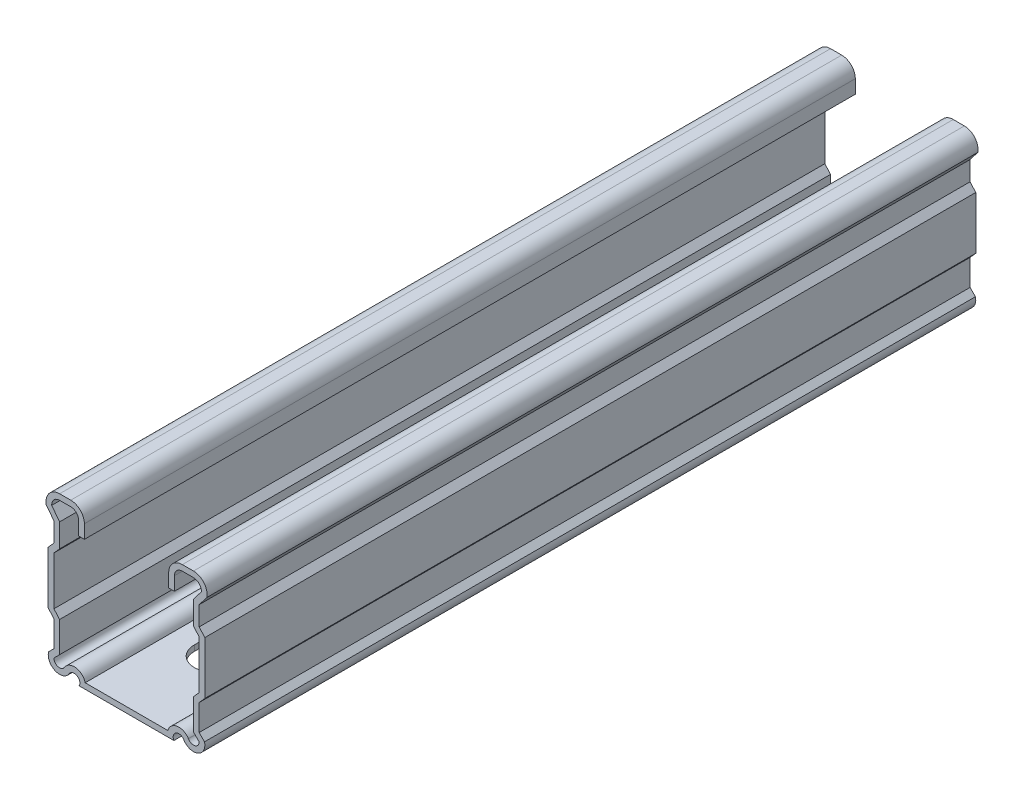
ISO-10303-21;
HEADER;
FILE_DESCRIPTION(('STEP AP214'),'2;1');
FILE_NAME('part.step','',(''),(''),'','','');
FILE_SCHEMA(('AUTOMOTIVE_DESIGN { 1 0 10303 214 1 1 1 1 }'));
ENDSEC;
DATA;
#1=APPLICATION_CONTEXT('core data for automotive mechanical design processes');
#2=APPLICATION_PROTOCOL_DEFINITION('international standard','automotive_design',2000,#1);
#3=PRODUCT_CONTEXT('',#1,'mechanical');
#4=PRODUCT('Part','Part','',(#3));
#5=PRODUCT_RELATED_PRODUCT_CATEGORY('part','',(#4));
#6=PRODUCT_DEFINITION_FORMATION('','',#4);
#7=PRODUCT_DEFINITION_CONTEXT('part definition',#1,'design');
#8=PRODUCT_DEFINITION('design','',#6,#7);
#9=PRODUCT_DEFINITION_SHAPE('','',#8);
#10=(LENGTH_UNIT() NAMED_UNIT(*) SI_UNIT(.MILLI.,.METRE.));
#11=(NAMED_UNIT(*) PLANE_ANGLE_UNIT() SI_UNIT($,.RADIAN.));
#12=(NAMED_UNIT(*) SI_UNIT($,.STERADIAN.) SOLID_ANGLE_UNIT());
#13=UNCERTAINTY_MEASURE_WITH_UNIT(LENGTH_MEASURE(1.E-05),#10,'distance_accuracy_value','');
#14=(GEOMETRIC_REPRESENTATION_CONTEXT(3) GLOBAL_UNCERTAINTY_ASSIGNED_CONTEXT((#13)) GLOBAL_UNIT_ASSIGNED_CONTEXT((#10,
#11,#12)) REPRESENTATION_CONTEXT('',''));
#15=CARTESIAN_POINT('',(0.,0.,0.));
#16=DIRECTION('',(0.,0.,1.));
#17=DIRECTION('',(1.,0.,0.));
#18=AXIS2_PLACEMENT_3D('',#15,#16,#17);
#19=CARTESIAN_POINT('',(13.7938113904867,-17.794678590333,203.2));
#20=DIRECTION('',(0.,0.,-1.));
#21=DIRECTION('',(-1.,0.,0.));
#22=AXIS2_PLACEMENT_3D('',#19,#20,#21);
#23=CYLINDRICAL_SURFACE('',#22,2.9972);
#24=CARTESIAN_POINT('',(13.7938113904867,-17.794678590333,0.));
#25=DIRECTION('',(0.,0.,1.));
#26=DIRECTION('',(1.,0.,0.));
#27=AXIS2_PLACEMENT_3D('',#24,#25,#26);
#28=CIRCLE('',#27,2.9972);
#29=CARTESIAN_POINT('',(16.3051886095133,-16.158771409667,0.));
#30=VERTEX_POINT('',#29);
#31=CARTESIAN_POINT('',(10.8989921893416,-17.018,0.));
#32=VERTEX_POINT('',#31);
#33=EDGE_CURVE('E506',#30,#32,#28,.T.);
#34=ORIENTED_EDGE('',*,*,#33,.T.);
#35=DIRECTION('',(0.,0.,-1.));
#36=VECTOR('',#35,1.);
#37=CARTESIAN_POINT('',(10.8989921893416,-17.018,203.2));
#38=LINE('',#37,#36);
#39=CARTESIAN_POINT('',(10.8989921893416,-17.018,203.2));
#40=VERTEX_POINT('',#39);
#41=EDGE_CURVE('E11',#40,#32,#38,.T.);
#42=ORIENTED_EDGE('',*,*,#41,.F.);
#43=CARTESIAN_POINT('',(13.7938113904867,-17.794678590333,203.2));
#44=DIRECTION('',(0.,0.,1.));
#45=DIRECTION('',(1.,0.,0.));
#46=AXIS2_PLACEMENT_3D('',#43,#44,#45);
#47=CIRCLE('',#46,2.9972);
#48=CARTESIAN_POINT('',(16.3051886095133,-16.158771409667,203.2));
#49=VERTEX_POINT('',#48);
#50=EDGE_CURVE('E507',#49,#40,#47,.T.);
#51=ORIENTED_EDGE('',*,*,#50,.F.);
#52=DIRECTION('',(0.,0.,-1.));
#53=VECTOR('',#52,1.);
#54=CARTESIAN_POINT('',(16.3051886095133,-16.158771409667,203.2));
#55=LINE('',#54,#53);
#56=EDGE_CURVE('E621',#49,#30,#55,.T.);
#57=ORIENTED_EDGE('',*,*,#56,.T.);
#58=EDGE_LOOP('',(#34,#42,#51,#57));
#59=FACE_BOUND('',#58,.T.);
#60=ADVANCED_FACE('F39',(#59),#23,.T.);
#61=CARTESIAN_POINT('',(-10.8989921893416,-17.018,203.2));
#62=DIRECTION('',(0.,-1.,0.));
#63=DIRECTION('',(1.,0.,0.));
#64=AXIS2_PLACEMENT_3D('',#61,#62,#63);
#65=PLANE('',#64);
#66=DIRECTION('',(0.,0.,1.));
#67=VECTOR('',#66,1.);
#68=CARTESIAN_POINT('',(5.15937499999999,-17.018,304.8));
#69=LINE('',#68,#67);
#70=CARTESIAN_POINT('',(5.15937500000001,-17.018,114.3));
#71=VERTEX_POINT('',#70);
#72=CARTESIAN_POINT('',(5.159375,-17.018,180.18125));
#73=VERTEX_POINT('',#72);
#74=EDGE_CURVE('E467',#71,#73,#69,.T.);
#75=ORIENTED_EDGE('',*,*,#74,.T.);
#76=CARTESIAN_POINT('',(0.,-17.018,180.18125));
#77=DIRECTION('',(0.,-1.,0.));
#78=DIRECTION('',(1.,0.,0.));
#79=AXIS2_PLACEMENT_3D('',#76,#77,#78);
#80=CIRCLE('',#79,5.159375);
#81=CARTESIAN_POINT('',(-5.15937500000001,-17.018,180.18125));
#82=VERTEX_POINT('',#81);
#83=EDGE_CURVE('E471',#73,#82,#80,.T.);
#84=ORIENTED_EDGE('',*,*,#83,.T.);
#85=DIRECTION('',(0.,0.,-1.));
#86=VECTOR('',#85,1.);
#87=CARTESIAN_POINT('',(-5.15937500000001,-17.018,304.8));
#88=LINE('',#87,#86);
#89=CARTESIAN_POINT('',(-5.15937500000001,-17.018,114.3));
#90=VERTEX_POINT('',#89);
#91=EDGE_CURVE('E448',#82,#90,#88,.T.);
#92=ORIENTED_EDGE('',*,*,#91,.T.);
#93=CARTESIAN_POINT('',(0.,-17.018,114.3));
#94=DIRECTION('',(0.,-1.,0.));
#95=DIRECTION('',(1.,0.,0.));
#96=AXIS2_PLACEMENT_3D('',#93,#94,#95);
#97=CIRCLE('',#96,5.15937500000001);
#98=EDGE_CURVE('E53',#90,#71,#97,.T.);
#99=ORIENTED_EDGE('',*,*,#98,.T.);
#100=EDGE_LOOP('',(#75,#84,#92,#99));
#101=FACE_BOUND('',#100,.T.);
#102=DIRECTION('',(0.,0.,1.));
#103=VECTOR('',#102,1.);
#104=CARTESIAN_POINT('',(5.15937499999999,-17.018,203.2));
#105=LINE('',#104,#103);
#106=CARTESIAN_POINT('',(5.15937500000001,-17.018,12.7));
#107=VERTEX_POINT('',#106);
#108=CARTESIAN_POINT('',(5.159375,-17.018,78.58125));
#109=VERTEX_POINT('',#108);
#110=EDGE_CURVE('E500',#107,#109,#105,.T.);
#111=ORIENTED_EDGE('',*,*,#110,.T.);
#112=CARTESIAN_POINT('',(0.,-17.018,78.58125));
#113=DIRECTION('',(0.,-1.,0.));
#114=DIRECTION('',(1.,0.,0.));
#115=AXIS2_PLACEMENT_3D('',#112,#113,#114);
#116=CIRCLE('',#115,5.159375);
#117=CARTESIAN_POINT('',(-5.15937500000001,-17.018,78.58125));
#118=VERTEX_POINT('',#117);
#119=EDGE_CURVE('E503',#109,#118,#116,.T.);
#120=ORIENTED_EDGE('',*,*,#119,.T.);
#121=DIRECTION('',(0.,0.,-1.));
#122=VECTOR('',#121,1.);
#123=CARTESIAN_POINT('',(-5.15937500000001,-17.018,203.2));
#124=LINE('',#123,#122);
#125=CARTESIAN_POINT('',(-5.15937500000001,-17.018,12.7));
#126=VERTEX_POINT('',#125);
#127=EDGE_CURVE('E488',#118,#126,#124,.T.);
#128=ORIENTED_EDGE('',*,*,#127,.T.);
#129=CARTESIAN_POINT('',(0.,-17.018,12.7));
#130=DIRECTION('',(0.,-1.,0.));
#131=DIRECTION('',(1.,0.,0.));
#132=AXIS2_PLACEMENT_3D('',#129,#130,#131);
#133=CIRCLE('',#132,5.15937500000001);
#134=EDGE_CURVE('E497',#126,#107,#133,.T.);
#135=ORIENTED_EDGE('',*,*,#134,.T.);
#136=EDGE_LOOP('',(#111,#120,#128,#135));
#137=FACE_BOUND('',#136,.T.);
#138=DIRECTION('',(-1.,0.,0.));
#139=VECTOR('',#138,1.);
#140=CARTESIAN_POINT('',(-10.8989921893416,-17.018,0.));
#141=LINE('',#140,#139);
#142=CARTESIAN_POINT('',(-10.8989921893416,-17.018,0.));
#143=VERTEX_POINT('',#142);
#144=EDGE_CURVE('E624',#32,#143,#141,.T.);
#145=ORIENTED_EDGE('',*,*,#144,.T.);
#146=DIRECTION('',(0.,0.,-1.));
#147=VECTOR('',#146,1.);
#148=CARTESIAN_POINT('',(-10.8989921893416,-17.018,203.2));
#149=LINE('',#148,#147);
#150=CARTESIAN_POINT('',(-10.8989921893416,-17.018,203.2));
#151=VERTEX_POINT('',#150);
#152=EDGE_CURVE('E46',#151,#143,#149,.T.);
#153=ORIENTED_EDGE('',*,*,#152,.F.);
#154=DIRECTION('',(-1.,0.,0.));
#155=VECTOR('',#154,1.);
#156=CARTESIAN_POINT('',(-10.8989921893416,-17.018,203.2));
#157=LINE('',#156,#155);
#158=EDGE_CURVE('E510',#40,#151,#157,.T.);
#159=ORIENTED_EDGE('',*,*,#158,.F.);
#160=ORIENTED_EDGE('',*,*,#41,.T.);
#161=EDGE_LOOP('',(#145,#153,#159,#160));
#162=FACE_BOUND('',#161,.T.);
#163=ADVANCED_FACE('F921',(#101,#137,#162),#65,.F.);
#164=CARTESIAN_POINT('',(-13.7938113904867,-17.794678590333,203.2));
#165=DIRECTION('',(0.,0.,-1.));
#166=DIRECTION('',(-1.,0.,0.));
#167=AXIS2_PLACEMENT_3D('',#164,#165,#166);
#168=CYLINDRICAL_SURFACE('',#167,2.9972);
#169=CARTESIAN_POINT('',(-13.7938113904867,-17.794678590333,0.));
#170=DIRECTION('',(0.,0.,1.));
#171=DIRECTION('',(-1.,0.,0.));
#172=AXIS2_PLACEMENT_3D('',#169,#170,#171);
#173=CIRCLE('',#172,2.9972);
#174=CARTESIAN_POINT('',(-16.4142858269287,-16.3399203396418,0.));
#175=VERTEX_POINT('',#174);
#176=EDGE_CURVE('E626',#143,#175,#173,.T.);
#177=ORIENTED_EDGE('',*,*,#176,.T.);
#178=DIRECTION('',(0.,0.,-1.));
#179=VECTOR('',#178,1.);
#180=CARTESIAN_POINT('',(-16.4142858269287,-16.3399203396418,203.2));
#181=LINE('',#180,#179);
#182=CARTESIAN_POINT('',(-16.4142858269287,-16.3399203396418,203.2));
#183=VERTEX_POINT('',#182);
#184=EDGE_CURVE('E891',#183,#175,#181,.T.);
#185=ORIENTED_EDGE('',*,*,#184,.F.);
#186=CARTESIAN_POINT('',(-13.7938113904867,-17.794678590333,203.2));
#187=DIRECTION('',(0.,0.,1.));
#188=DIRECTION('',(-1.,0.,0.));
#189=AXIS2_PLACEMENT_3D('',#186,#187,#188);
#190=CIRCLE('',#189,2.9972);
#191=EDGE_CURVE('E513',#151,#183,#190,.T.);
#192=ORIENTED_EDGE('',*,*,#191,.F.);
#193=ORIENTED_EDGE('',*,*,#152,.T.);
#194=EDGE_LOOP('',(#177,#185,#192,#193));
#195=FACE_BOUND('',#194,.T.);
#196=ADVANCED_FACE('F898',(#195),#168,.T.);
#197=CARTESIAN_POINT('',(-17.6403,-15.478125,203.2));
#198=DIRECTION('',(0.,0.,-1.));
#199=DIRECTION('',(-1.,0.,0.));
#200=AXIS2_PLACEMENT_3D('',#197,#198,#199);
#201=CYLINDRICAL_SURFACE('',#200,1.4986);
#202=CARTESIAN_POINT('',(-17.6403,-15.478125,0.));
#203=DIRECTION('',(0.,0.,-1.));
#204=DIRECTION('',(1.,0.,0.));
#205=AXIS2_PLACEMENT_3D('',#202,#203,#204);
#206=CIRCLE('',#205,1.4986);
#207=CARTESIAN_POINT('',(-19.1389,-15.478125,0.));
#208=VERTEX_POINT('',#207);
#209=EDGE_CURVE('E628',#175,#208,#206,.T.);
#210=ORIENTED_EDGE('',*,*,#209,.T.);
#211=DIRECTION('',(0.,0.,-1.));
#212=VECTOR('',#211,1.);
#213=CARTESIAN_POINT('',(-19.1389,-15.478125,203.2));
#214=LINE('',#213,#212);
#215=CARTESIAN_POINT('',(-19.1389,-15.478125,203.2));
#216=VERTEX_POINT('',#215);
#217=EDGE_CURVE('E888',#216,#208,#214,.T.);
#218=ORIENTED_EDGE('',*,*,#217,.F.);
#219=CARTESIAN_POINT('',(-17.6403,-15.478125,203.2));
#220=DIRECTION('',(0.,0.,-1.));
#221=DIRECTION('',(1.,0.,0.));
#222=AXIS2_PLACEMENT_3D('',#219,#220,#221);
#223=CIRCLE('',#222,1.4986);
#224=EDGE_CURVE('E515',#183,#216,#223,.T.);
#225=ORIENTED_EDGE('',*,*,#224,.F.);
#226=ORIENTED_EDGE('',*,*,#184,.T.);
#227=EDGE_LOOP('',(#210,#218,#225,#226));
#228=FACE_BOUND('',#227,.T.);
#229=ADVANCED_FACE('F909',(#228),#201,.F.);
#230=CARTESIAN_POINT('',(-17.6403,-13.979525,203.2));
#231=DIRECTION('',(-0.707106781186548,0.707106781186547,0.));
#232=DIRECTION('',(-0.707106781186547,-0.707106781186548,0.));
#233=AXIS2_PLACEMENT_3D('',#230,#231,#232);
#234=PLANE('',#233);
#235=DIRECTION('',(0.707106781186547,0.707106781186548,0.));
#236=VECTOR('',#235,1.);
#237=CARTESIAN_POINT('',(-17.6403,-13.979525,0.));
#238=LINE('',#237,#236);
#239=CARTESIAN_POINT('',(-17.6403,-13.979525,0.));
#240=VERTEX_POINT('',#239);
#241=EDGE_CURVE('E630',#208,#240,#238,.T.);
#242=ORIENTED_EDGE('',*,*,#241,.T.);
#243=DIRECTION('',(0.,0.,-1.));
#244=VECTOR('',#243,1.);
#245=CARTESIAN_POINT('',(-17.6403,-13.979525,203.2));
#246=LINE('',#245,#244);
#247=CARTESIAN_POINT('',(-17.6403,-13.979525,203.2));
#248=VERTEX_POINT('',#247);
#249=EDGE_CURVE('E885',#248,#240,#246,.T.);
#250=ORIENTED_EDGE('',*,*,#249,.F.);
#251=DIRECTION('',(0.707106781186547,0.707106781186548,0.));
#252=VECTOR('',#251,1.);
#253=CARTESIAN_POINT('',(-17.6403,-13.979525,203.2));
#254=LINE('',#253,#252);
#255=EDGE_CURVE('E517',#216,#248,#254,.T.);
#256=ORIENTED_EDGE('',*,*,#255,.F.);
#257=ORIENTED_EDGE('',*,*,#217,.T.);
#258=EDGE_LOOP('',(#242,#250,#256,#257));
#259=FACE_BOUND('',#258,.T.);
#260=ADVANCED_FACE('F913',(#259),#234,.F.);
#261=CARTESIAN_POINT('',(-17.6403,-13.979525,203.2));
#262=DIRECTION('',(-1.,0.,0.));
#263=DIRECTION('',(0.,-1.,0.));
#264=AXIS2_PLACEMENT_3D('',#261,#262,#263);
#265=PLANE('',#264);
#266=DIRECTION('',(0.,1.,0.));
#267=VECTOR('',#266,1.);
#268=CARTESIAN_POINT('',(-17.6403,-13.979525,0.));
#269=LINE('',#268,#267);
#270=CARTESIAN_POINT('',(-17.6403,-5.93680201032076,0.));
#271=VERTEX_POINT('',#270);
#272=EDGE_CURVE('E632',#240,#271,#269,.T.);
#273=ORIENTED_EDGE('',*,*,#272,.T.);
#274=DIRECTION('',(0.,0.,-1.));
#275=VECTOR('',#274,1.);
#276=CARTESIAN_POINT('',(-17.6403,-5.93680201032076,203.2));
#277=LINE('',#276,#275);
#278=CARTESIAN_POINT('',(-17.6403,-5.93680201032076,203.2));
#279=VERTEX_POINT('',#278);
#280=EDGE_CURVE('E882',#279,#271,#277,.T.);
#281=ORIENTED_EDGE('',*,*,#280,.F.);
#282=DIRECTION('',(0.,1.,0.));
#283=VECTOR('',#282,1.);
#284=CARTESIAN_POINT('',(-17.6403,-13.979525,203.2));
#285=LINE('',#284,#283);
#286=EDGE_CURVE('E519',#248,#279,#285,.T.);
#287=ORIENTED_EDGE('',*,*,#286,.F.);
#288=ORIENTED_EDGE('',*,*,#249,.T.);
#289=EDGE_LOOP('',(#273,#281,#287,#288));
#290=FACE_BOUND('',#289,.T.);
#291=ADVANCED_FACE('F1173',(#290),#265,.F.);
#292=CARTESIAN_POINT('',(-17.6403,-5.93680201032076,203.2));
#293=DIRECTION('',(-0.746819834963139,-0.665026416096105,0.));
#294=DIRECTION('',(0.665026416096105,-0.746819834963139,0.));
#295=AXIS2_PLACEMENT_3D('',#292,#293,#294);
#296=PLANE('',#295);
#297=DIRECTION('',(-0.665026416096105,0.746819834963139,0.));
#298=VECTOR('',#297,1.);
#299=CARTESIAN_POINT('',(-17.6403,-5.93680201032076,0.));
#300=LINE('',#299,#298);
#301=CARTESIAN_POINT('',(-19.1389,-4.25388509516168,0.));
#302=VERTEX_POINT('',#301);
#303=EDGE_CURVE('E634',#271,#302,#300,.T.);
#304=ORIENTED_EDGE('',*,*,#303,.T.);
#305=DIRECTION('',(0.,0.,-1.));
#306=VECTOR('',#305,1.);
#307=CARTESIAN_POINT('',(-19.1389,-4.25388509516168,203.2));
#308=LINE('',#307,#306);
#309=CARTESIAN_POINT('',(-19.1389,-4.25388509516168,203.2));
#310=VERTEX_POINT('',#309);
#311=EDGE_CURVE('E879',#310,#302,#308,.T.);
#312=ORIENTED_EDGE('',*,*,#311,.F.);
#313=DIRECTION('',(-0.665026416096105,0.746819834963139,0.));
#314=VECTOR('',#313,1.);
#315=CARTESIAN_POINT('',(-17.6403,-5.93680201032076,203.2));
#316=LINE('',#315,#314);
#317=EDGE_CURVE('E521',#279,#310,#316,.T.);
#318=ORIENTED_EDGE('',*,*,#317,.F.);
#319=ORIENTED_EDGE('',*,*,#280,.T.);
#320=EDGE_LOOP('',(#304,#312,#318,#319));
#321=FACE_BOUND('',#320,.T.);
#322=ADVANCED_FACE('F1171',(#321),#296,.F.);
#323=CARTESIAN_POINT('',(-19.1389,-4.25388509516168,203.2));
#324=DIRECTION('',(-1.,0.,0.));
#325=DIRECTION('',(0.,0.,1.));
#326=AXIS2_PLACEMENT_3D('',#323,#324,#325);
#327=PLANE('',#326);
#328=DIRECTION('',(0.,1.,0.));
#329=VECTOR('',#328,1.);
#330=CARTESIAN_POINT('',(-19.1389,-4.25388509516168,0.));
#331=LINE('',#330,#329);
#332=CARTESIAN_POINT('',(-19.1389,8.49568509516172,0.));
#333=VERTEX_POINT('',#332);
#334=EDGE_CURVE('E636',#302,#333,#331,.T.);
#335=ORIENTED_EDGE('',*,*,#334,.T.);
#336=DIRECTION('',(0.,0.,-1.));
#337=VECTOR('',#336,1.);
#338=CARTESIAN_POINT('',(-19.1389,8.49568509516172,203.2));
#339=LINE('',#338,#337);
#340=CARTESIAN_POINT('',(-19.1389,8.49568509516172,203.2));
#341=VERTEX_POINT('',#340);
#342=EDGE_CURVE('E876',#341,#333,#339,.T.);
#343=ORIENTED_EDGE('',*,*,#342,.F.);
#344=DIRECTION('',(0.,1.,0.));
#345=VECTOR('',#344,1.);
#346=CARTESIAN_POINT('',(-19.1389,-4.25388509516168,203.2));
#347=LINE('',#346,#345);
#348=EDGE_CURVE('E523',#310,#341,#347,.T.);
#349=ORIENTED_EDGE('',*,*,#348,.F.);
#350=ORIENTED_EDGE('',*,*,#311,.T.);
#351=EDGE_LOOP('',(#335,#343,#349,#350));
#352=FACE_BOUND('',#351,.T.);
#353=ADVANCED_FACE('F1166',(#352),#327,.F.);
#354=CARTESIAN_POINT('',(-17.6403,10.178602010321,203.2));
#355=DIRECTION('',(-0.746819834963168,0.665026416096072,0.));
#356=DIRECTION('',(-0.665026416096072,-0.746819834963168,0.));
#357=AXIS2_PLACEMENT_3D('',#354,#355,#356);
#358=PLANE('',#357);
#359=DIRECTION('',(0.665026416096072,0.746819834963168,0.));
#360=VECTOR('',#359,1.);
#361=CARTESIAN_POINT('',(-17.6403,10.178602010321,0.));
#362=LINE('',#361,#360);
#363=CARTESIAN_POINT('',(-17.6403,10.178602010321,0.));
#364=VERTEX_POINT('',#363);
#365=EDGE_CURVE('E638',#333,#364,#362,.T.);
#366=ORIENTED_EDGE('',*,*,#365,.T.);
#367=DIRECTION('',(0.,0.,-1.));
#368=VECTOR('',#367,1.);
#369=CARTESIAN_POINT('',(-17.6403,10.178602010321,203.2));
#370=LINE('',#369,#368);
#371=CARTESIAN_POINT('',(-17.6403,10.178602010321,203.2));
#372=VERTEX_POINT('',#371);
#373=EDGE_CURVE('E873',#372,#364,#370,.T.);
#374=ORIENTED_EDGE('',*,*,#373,.F.);
#375=DIRECTION('',(0.665026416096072,0.746819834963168,0.));
#376=VECTOR('',#375,1.);
#377=CARTESIAN_POINT('',(-17.6403,10.178602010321,203.2));
#378=LINE('',#377,#376);
#379=EDGE_CURVE('E525',#341,#372,#378,.T.);
#380=ORIENTED_EDGE('',*,*,#379,.F.);
#381=ORIENTED_EDGE('',*,*,#342,.T.);
#382=EDGE_LOOP('',(#366,#374,#380,#381));
#383=FACE_BOUND('',#382,.T.);
#384=ADVANCED_FACE('F1161',(#383),#358,.F.);
#385=CARTESIAN_POINT('',(-17.6403,10.178602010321,203.2));
#386=DIRECTION('',(-1.,0.,0.));
#387=DIRECTION('',(0.,0.,1.));
#388=AXIS2_PLACEMENT_3D('',#385,#386,#387);
#389=PLANE('',#388);
#390=DIRECTION('',(0.,1.,0.));
#391=VECTOR('',#390,1.);
#392=CARTESIAN_POINT('',(-17.6403,10.178602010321,0.));
#393=LINE('',#392,#391);
#394=CARTESIAN_POINT('',(-17.6403,16.3392865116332,0.));
#395=VERTEX_POINT('',#394);
#396=EDGE_CURVE('E640',#364,#395,#393,.T.);
#397=ORIENTED_EDGE('',*,*,#396,.T.);
#398=DIRECTION('',(0.,0.,-1.));
#399=VECTOR('',#398,1.);
#400=CARTESIAN_POINT('',(-17.6403,16.3392865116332,203.2));
#401=LINE('',#400,#399);
#402=CARTESIAN_POINT('',(-17.6403,16.3392865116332,203.2));
#403=VERTEX_POINT('',#402);
#404=EDGE_CURVE('E870',#403,#395,#401,.T.);
#405=ORIENTED_EDGE('',*,*,#404,.F.);
#406=DIRECTION('',(0.,1.,0.));
#407=VECTOR('',#406,1.);
#408=CARTESIAN_POINT('',(-17.6403,10.178602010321,203.2));
#409=LINE('',#408,#407);
#410=EDGE_CURVE('E527',#372,#403,#409,.T.);
#411=ORIENTED_EDGE('',*,*,#410,.F.);
#412=ORIENTED_EDGE('',*,*,#373,.T.);
#413=EDGE_LOOP('',(#397,#405,#411,#412));
#414=FACE_BOUND('',#413,.T.);
#415=ADVANCED_FACE('F1157',(#414),#389,.F.);
#416=CARTESIAN_POINT('',(-17.6403,16.3392865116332,203.2));
#417=DIRECTION('',(-0.793466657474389,-0.608613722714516,0.));
#418=DIRECTION('',(0.608613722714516,-0.793466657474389,0.));
#419=AXIS2_PLACEMENT_3D('',#416,#417,#418);
#420=PLANE('',#419);
#421=DIRECTION('',(-0.608613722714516,0.793466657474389,0.));
#422=VECTOR('',#421,1.);
#423=CARTESIAN_POINT('',(-17.6403,16.3392865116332,0.));
#424=LINE('',#423,#422);
#425=CARTESIAN_POINT('',(-19.7298825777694,19.0635335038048,0.));
#426=VERTEX_POINT('',#425);
#427=EDGE_CURVE('E642',#395,#426,#424,.T.);
#428=ORIENTED_EDGE('',*,*,#427,.T.);
#429=DIRECTION('',(0.,0.,-1.));
#430=VECTOR('',#429,1.);
#431=CARTESIAN_POINT('',(-19.7298825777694,19.0635335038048,203.2));
#432=LINE('',#431,#430);
#433=CARTESIAN_POINT('',(-19.7298825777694,19.0635335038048,203.2));
#434=VERTEX_POINT('',#433);
#435=EDGE_CURVE('E867',#434,#426,#432,.T.);
#436=ORIENTED_EDGE('',*,*,#435,.F.);
#437=DIRECTION('',(-0.608613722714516,0.793466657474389,0.));
#438=VECTOR('',#437,1.);
#439=CARTESIAN_POINT('',(-17.6403,16.3392865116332,203.2));
#440=LINE('',#439,#438);
#441=EDGE_CURVE('E529',#403,#434,#440,.T.);
#442=ORIENTED_EDGE('',*,*,#441,.F.);
#443=ORIENTED_EDGE('',*,*,#404,.T.);
#444=EDGE_LOOP('',(#428,#436,#442,#443));
#445=FACE_BOUND('',#444,.T.);
#446=ADVANCED_FACE('F1152',(#445),#420,.F.);
#447=CARTESIAN_POINT('',(-17.6403,19.1676263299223,203.2));
#448=DIRECTION('',(0.,0.,-1.));
#449=DIRECTION('',(-1.,0.,0.));
#450=AXIS2_PLACEMENT_3D('',#447,#448,#449);
#451=CYLINDRICAL_SURFACE('',#450,2.09217367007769);
#452=CARTESIAN_POINT('',(-17.6403,19.1676263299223,0.));
#453=DIRECTION('',(0.,0.,-1.));
#454=DIRECTION('',(1.,0.,0.));
#455=AXIS2_PLACEMENT_3D('',#452,#453,#454);
#456=CIRCLE('',#455,2.09217367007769);
#457=CARTESIAN_POINT('',(-17.6403,21.2598,0.));
#458=VERTEX_POINT('',#457);
#459=EDGE_CURVE('E644',#426,#458,#456,.T.);
#460=ORIENTED_EDGE('',*,*,#459,.T.);
#461=DIRECTION('',(0.,0.,-1.));
#462=VECTOR('',#461,1.);
#463=CARTESIAN_POINT('',(-17.6403,21.2598,203.2));
#464=LINE('',#463,#462);
#465=CARTESIAN_POINT('',(-17.6403,21.2598,203.2));
#466=VERTEX_POINT('',#465);
#467=EDGE_CURVE('E864',#466,#458,#464,.T.);
#468=ORIENTED_EDGE('',*,*,#467,.F.);
#469=CARTESIAN_POINT('',(-17.6403,19.1676263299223,203.2));
#470=DIRECTION('',(0.,0.,-1.));
#471=DIRECTION('',(1.,0.,0.));
#472=AXIS2_PLACEMENT_3D('',#469,#470,#471);
#473=CIRCLE('',#472,2.09217367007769);
#474=EDGE_CURVE('E531',#434,#466,#473,.T.);
#475=ORIENTED_EDGE('',*,*,#474,.F.);
#476=ORIENTED_EDGE('',*,*,#435,.T.);
#477=EDGE_LOOP('',(#460,#468,#475,#476));
#478=FACE_BOUND('',#477,.T.);
#479=ADVANCED_FACE('F1146',(#478),#451,.F.);
#480=CARTESIAN_POINT('',(-17.6403,21.2598,203.2));
#481=DIRECTION('',(0.,1.,0.));
#482=DIRECTION('',(0.,0.,1.));
#483=AXIS2_PLACEMENT_3D('',#480,#481,#482);
#484=PLANE('',#483);
#485=DIRECTION('',(1.,0.,0.));
#486=VECTOR('',#485,1.);
#487=CARTESIAN_POINT('',(-17.6403,21.2598,0.));
#488=LINE('',#487,#486);
#489=CARTESIAN_POINT('',(-14.7032736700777,21.2598,0.));
#490=VERTEX_POINT('',#489);
#491=EDGE_CURVE('E646',#458,#490,#488,.T.);
#492=ORIENTED_EDGE('',*,*,#491,.T.);
#493=DIRECTION('',(0.,0.,-1.));
#494=VECTOR('',#493,1.);
#495=CARTESIAN_POINT('',(-14.7032736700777,21.2598,203.2));
#496=LINE('',#495,#494);
#497=CARTESIAN_POINT('',(-14.7032736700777,21.2598,203.2));
#498=VERTEX_POINT('',#497);
#499=EDGE_CURVE('E861',#498,#490,#496,.T.);
#500=ORIENTED_EDGE('',*,*,#499,.F.);
#501=DIRECTION('',(1.,0.,0.));
#502=VECTOR('',#501,1.);
#503=CARTESIAN_POINT('',(-17.6403,21.2598,203.2));
#504=LINE('',#503,#502);
#505=EDGE_CURVE('E533',#466,#498,#504,.T.);
#506=ORIENTED_EDGE('',*,*,#505,.F.);
#507=ORIENTED_EDGE('',*,*,#467,.T.);
#508=EDGE_LOOP('',(#492,#500,#506,#507));
#509=FACE_BOUND('',#508,.T.);
#510=ADVANCED_FACE('F1142',(#509),#484,.F.);
#511=CARTESIAN_POINT('',(-14.7032736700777,19.1676263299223,203.2));
#512=DIRECTION('',(0.,0.,-1.));
#513=DIRECTION('',(-1.,0.,0.));
#514=AXIS2_PLACEMENT_3D('',#511,#512,#513);
#515=CYLINDRICAL_SURFACE('',#514,2.09217367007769);
#516=CARTESIAN_POINT('',(-14.7032736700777,19.1676263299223,0.));
#517=DIRECTION('',(0.,0.,-1.));
#518=DIRECTION('',(1.,0.,0.));
#519=AXIS2_PLACEMENT_3D('',#516,#517,#518);
#520=CIRCLE('',#519,2.09217367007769);
#521=CARTESIAN_POINT('',(-12.6111,19.1676263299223,0.));
#522=VERTEX_POINT('',#521);
#523=EDGE_CURVE('E648',#490,#522,#520,.T.);
#524=ORIENTED_EDGE('',*,*,#523,.T.);
#525=DIRECTION('',(0.,0.,-1.));
#526=VECTOR('',#525,1.);
#527=CARTESIAN_POINT('',(-12.6111,19.1676263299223,203.2));
#528=LINE('',#527,#526);
#529=CARTESIAN_POINT('',(-12.6111,19.1676263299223,203.2));
#530=VERTEX_POINT('',#529);
#531=EDGE_CURVE('E858',#530,#522,#528,.T.);
#532=ORIENTED_EDGE('',*,*,#531,.F.);
#533=CARTESIAN_POINT('',(-14.7032736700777,19.1676263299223,203.2));
#534=DIRECTION('',(0.,0.,-1.));
#535=DIRECTION('',(1.,0.,0.));
#536=AXIS2_PLACEMENT_3D('',#533,#534,#535);
#537=CIRCLE('',#536,2.09217367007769);
#538=EDGE_CURVE('E535',#498,#530,#537,.T.);
#539=ORIENTED_EDGE('',*,*,#538,.F.);
#540=ORIENTED_EDGE('',*,*,#499,.T.);
#541=EDGE_LOOP('',(#524,#532,#539,#540));
#542=FACE_BOUND('',#541,.T.);
#543=ADVANCED_FACE('F1137',(#542),#515,.F.);
#544=CARTESIAN_POINT('',(-12.6111,19.1676263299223,203.2));
#545=DIRECTION('',(1.,0.,0.));
#546=DIRECTION('',(0.,0.,-1.));
#547=AXIS2_PLACEMENT_3D('',#544,#545,#546);
#548=PLANE('',#547);
#549=DIRECTION('',(0.,-1.,0.));
#550=VECTOR('',#549,1.);
#551=CARTESIAN_POINT('',(-12.6111,19.1676263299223,0.));
#552=LINE('',#551,#550);
#553=CARTESIAN_POINT('',(-12.6111,15.61465,0.));
#554=VERTEX_POINT('',#553);
#555=EDGE_CURVE('E650',#522,#554,#552,.T.);
#556=ORIENTED_EDGE('',*,*,#555,.T.);
#557=DIRECTION('',(0.,0.,-1.));
#558=VECTOR('',#557,1.);
#559=CARTESIAN_POINT('',(-12.6111,15.61465,203.2));
#560=LINE('',#559,#558);
#561=CARTESIAN_POINT('',(-12.6111,15.61465,203.2));
#562=VERTEX_POINT('',#561);
#563=EDGE_CURVE('E855',#562,#554,#560,.T.);
#564=ORIENTED_EDGE('',*,*,#563,.F.);
#565=DIRECTION('',(0.,-1.,0.));
#566=VECTOR('',#565,1.);
#567=CARTESIAN_POINT('',(-12.6111,19.1676263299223,203.2));
#568=LINE('',#567,#566);
#569=EDGE_CURVE('E537',#530,#562,#568,.T.);
#570=ORIENTED_EDGE('',*,*,#569,.F.);
#571=ORIENTED_EDGE('',*,*,#531,.T.);
#572=EDGE_LOOP('',(#556,#564,#570,#571));
#573=FACE_BOUND('',#572,.T.);
#574=ADVANCED_FACE('F1131',(#573),#548,.F.);
#575=CARTESIAN_POINT('',(-12.6111,15.61465,203.2));
#576=DIRECTION('',(0.,1.,0.));
#577=DIRECTION('',(0.,0.,1.));
#578=AXIS2_PLACEMENT_3D('',#575,#576,#577);
#579=PLANE('',#578);
#580=DIRECTION('',(1.,0.,0.));
#581=VECTOR('',#580,1.);
#582=CARTESIAN_POINT('',(-12.6111,15.61465,0.));
#583=LINE('',#582,#581);
#584=CARTESIAN_POINT('',(-11.1125,15.61465,0.));
#585=VERTEX_POINT('',#584);
#586=EDGE_CURVE('E652',#554,#585,#583,.T.);
#587=ORIENTED_EDGE('',*,*,#586,.T.);
#588=DIRECTION('',(0.,0.,-1.));
#589=VECTOR('',#588,1.);
#590=CARTESIAN_POINT('',(-11.1125,15.61465,203.2));
#591=LINE('',#590,#589);
#592=CARTESIAN_POINT('',(-11.1125,15.61465,203.2));
#593=VERTEX_POINT('',#592);
#594=EDGE_CURVE('E852',#593,#585,#591,.T.);
#595=ORIENTED_EDGE('',*,*,#594,.F.);
#596=DIRECTION('',(1.,0.,0.));
#597=VECTOR('',#596,1.);
#598=CARTESIAN_POINT('',(-12.6111,15.61465,203.2));
#599=LINE('',#598,#597);
#600=EDGE_CURVE('E539',#562,#593,#599,.T.);
#601=ORIENTED_EDGE('',*,*,#600,.F.);
#602=ORIENTED_EDGE('',*,*,#563,.T.);
#603=EDGE_LOOP('',(#587,#595,#601,#602));
#604=FACE_BOUND('',#603,.T.);
#605=ADVANCED_FACE('F1127',(#604),#579,.F.);
#606=CARTESIAN_POINT('',(-11.1125,19.1676263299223,203.2));
#607=DIRECTION('',(-1.,0.,0.));
#608=DIRECTION('',(0.,0.,1.));
#609=AXIS2_PLACEMENT_3D('',#606,#607,#608);
#610=PLANE('',#609);
#611=DIRECTION('',(0.,1.,0.));
#612=VECTOR('',#611,1.);
#613=CARTESIAN_POINT('',(-11.1125,19.1676263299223,0.));
#614=LINE('',#613,#612);
#615=CARTESIAN_POINT('',(-11.1125,19.1676263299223,0.));
#616=VERTEX_POINT('',#615);
#617=EDGE_CURVE('E654',#585,#616,#614,.T.);
#618=ORIENTED_EDGE('',*,*,#617,.T.);
#619=DIRECTION('',(0.,0.,-1.));
#620=VECTOR('',#619,1.);
#621=CARTESIAN_POINT('',(-11.1125,19.1676263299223,203.2));
#622=LINE('',#621,#620);
#623=CARTESIAN_POINT('',(-11.1125,19.1676263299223,203.2));
#624=VERTEX_POINT('',#623);
#625=EDGE_CURVE('E849',#624,#616,#622,.T.);
#626=ORIENTED_EDGE('',*,*,#625,.F.);
#627=DIRECTION('',(0.,1.,0.));
#628=VECTOR('',#627,1.);
#629=CARTESIAN_POINT('',(-11.1125,19.1676263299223,203.2));
#630=LINE('',#629,#628);
#631=EDGE_CURVE('E541',#593,#624,#630,.T.);
#632=ORIENTED_EDGE('',*,*,#631,.F.);
#633=ORIENTED_EDGE('',*,*,#594,.T.);
#634=EDGE_LOOP('',(#618,#626,#632,#633));
#635=FACE_BOUND('',#634,.T.);
#636=ADVANCED_FACE('F1122',(#635),#610,.F.);
#637=CARTESIAN_POINT('',(-14.7032736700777,19.1676263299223,203.2));
#638=DIRECTION('',(0.,0.,-1.));
#639=DIRECTION('',(-1.,0.,0.));
#640=AXIS2_PLACEMENT_3D('',#637,#638,#639);
#641=CYLINDRICAL_SURFACE('',#640,3.59077367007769);
#642=CARTESIAN_POINT('',(-14.7032736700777,19.1676263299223,0.));
#643=DIRECTION('',(0.,0.,1.));
#644=DIRECTION('',(1.,0.,0.));
#645=AXIS2_PLACEMENT_3D('',#642,#643,#644);
#646=CIRCLE('',#645,3.59077367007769);
#647=CARTESIAN_POINT('',(-14.7032736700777,22.7584,0.));
#648=VERTEX_POINT('',#647);
#649=EDGE_CURVE('E656',#616,#648,#646,.T.);
#650=ORIENTED_EDGE('',*,*,#649,.T.);
#651=DIRECTION('',(0.,0.,-1.));
#652=VECTOR('',#651,1.);
#653=CARTESIAN_POINT('',(-14.7032736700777,22.7584,203.2));
#654=LINE('',#653,#652);
#655=CARTESIAN_POINT('',(-14.7032736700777,22.7584,203.2));
#656=VERTEX_POINT('',#655);
#657=EDGE_CURVE('E846',#656,#648,#654,.T.);
#658=ORIENTED_EDGE('',*,*,#657,.F.);
#659=CARTESIAN_POINT('',(-14.7032736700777,19.1676263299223,203.2));
#660=DIRECTION('',(0.,0.,1.));
#661=DIRECTION('',(1.,0.,0.));
#662=AXIS2_PLACEMENT_3D('',#659,#660,#661);
#663=CIRCLE('',#662,3.59077367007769);
#664=EDGE_CURVE('E543',#624,#656,#663,.T.);
#665=ORIENTED_EDGE('',*,*,#664,.F.);
#666=ORIENTED_EDGE('',*,*,#625,.T.);
#667=EDGE_LOOP('',(#650,#658,#665,#666));
#668=FACE_BOUND('',#667,.T.);
#669=ADVANCED_FACE('F1116',(#668),#641,.T.);
#670=CARTESIAN_POINT('',(-17.6403,22.7584,203.2));
#671=DIRECTION('',(0.,-1.,0.));
#672=DIRECTION('',(1.,0.,0.));
#673=AXIS2_PLACEMENT_3D('',#670,#671,#672);
#674=PLANE('',#673);
#675=DIRECTION('',(-1.,0.,0.));
#676=VECTOR('',#675,1.);
#677=CARTESIAN_POINT('',(-17.6403,22.7584,0.));
#678=LINE('',#677,#676);
#679=CARTESIAN_POINT('',(-17.6403,22.7584,0.));
#680=VERTEX_POINT('',#679);
#681=EDGE_CURVE('E658',#648,#680,#678,.T.);
#682=ORIENTED_EDGE('',*,*,#681,.T.);
#683=DIRECTION('',(0.,0.,-1.));
#684=VECTOR('',#683,1.);
#685=CARTESIAN_POINT('',(-17.6403,22.7584,203.2));
#686=LINE('',#685,#684);
#687=CARTESIAN_POINT('',(-17.6403,22.7584,203.2));
#688=VERTEX_POINT('',#687);
#689=EDGE_CURVE('E843',#688,#680,#686,.T.);
#690=ORIENTED_EDGE('',*,*,#689,.F.);
#691=DIRECTION('',(-1.,0.,0.));
#692=VECTOR('',#691,1.);
#693=CARTESIAN_POINT('',(-17.6403,22.7584,203.2));
#694=LINE('',#693,#692);
#695=EDGE_CURVE('E545',#656,#688,#694,.T.);
#696=ORIENTED_EDGE('',*,*,#695,.F.);
#697=ORIENTED_EDGE('',*,*,#657,.T.);
#698=EDGE_LOOP('',(#682,#690,#696,#697));
#699=FACE_BOUND('',#698,.T.);
#700=ADVANCED_FACE('F1112',(#699),#674,.F.);
#701=CARTESIAN_POINT('',(-17.6403,19.1676263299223,203.2));
#702=DIRECTION('',(0.,0.,-1.));
#703=DIRECTION('',(-1.,0.,0.));
#704=AXIS2_PLACEMENT_3D('',#701,#702,#703);
#705=CYLINDRICAL_SURFACE('',#704,3.59077367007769);
#706=CARTESIAN_POINT('',(-17.6403,19.1676263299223,0.));
#707=DIRECTION('',(0.,0.,1.));
#708=DIRECTION('',(1.,0.,0.));
#709=AXIS2_PLACEMENT_3D('',#706,#707,#708);
#710=CIRCLE('',#709,3.59077367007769);
#711=CARTESIAN_POINT('',(-21.1624286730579,18.4688666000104,0.));
#712=VERTEX_POINT('',#711);
#713=EDGE_CURVE('E660',#680,#712,#710,.T.);
#714=ORIENTED_EDGE('',*,*,#713,.T.);
#715=DIRECTION('',(0.,0.,-1.));
#716=VECTOR('',#715,1.);
#717=CARTESIAN_POINT('',(-21.1624286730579,18.4688666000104,203.2));
#718=LINE('',#717,#716);
#719=CARTESIAN_POINT('',(-21.1624286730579,18.4688666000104,203.2));
#720=VERTEX_POINT('',#719);
#721=EDGE_CURVE('E840',#720,#712,#718,.T.);
#722=ORIENTED_EDGE('',*,*,#721,.F.);
#723=CARTESIAN_POINT('',(-17.6403,19.1676263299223,203.2));
#724=DIRECTION('',(0.,0.,1.));
#725=DIRECTION('',(1.,0.,0.));
#726=AXIS2_PLACEMENT_3D('',#723,#724,#725);
#727=CIRCLE('',#726,3.59077367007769);
#728=EDGE_CURVE('E547',#688,#720,#727,.T.);
#729=ORIENTED_EDGE('',*,*,#728,.F.);
#730=ORIENTED_EDGE('',*,*,#689,.T.);
#731=EDGE_LOOP('',(#714,#722,#729,#730));
#732=FACE_BOUND('',#731,.T.);
#733=ADVANCED_FACE('F1107',(#732),#705,.T.);
#734=CARTESIAN_POINT('',(-19.1389,15.8307359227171,203.2));
#735=DIRECTION('',(0.793466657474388,0.608613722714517,0.));
#736=DIRECTION('',(-0.608613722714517,0.793466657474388,0.));
#737=AXIS2_PLACEMENT_3D('',#734,#735,#736);
#738=PLANE('',#737);
#739=DIRECTION('',(0.608613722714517,-0.793466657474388,0.));
#740=VECTOR('',#739,1.);
#741=CARTESIAN_POINT('',(-19.1389,15.8307359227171,0.));
#742=LINE('',#741,#740);
#743=CARTESIAN_POINT('',(-19.1389,15.8307359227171,0.));
#744=VERTEX_POINT('',#743);
#745=EDGE_CURVE('E662',#712,#744,#742,.T.);
#746=ORIENTED_EDGE('',*,*,#745,.T.);
#747=DIRECTION('',(0.,0.,-1.));
#748=VECTOR('',#747,1.);
#749=CARTESIAN_POINT('',(-19.1389,15.8307359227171,203.2));
#750=LINE('',#749,#748);
#751=CARTESIAN_POINT('',(-19.1389,15.8307359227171,203.2));
#752=VERTEX_POINT('',#751);
#753=EDGE_CURVE('E837',#752,#744,#750,.T.);
#754=ORIENTED_EDGE('',*,*,#753,.F.);
#755=DIRECTION('',(0.608613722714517,-0.793466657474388,0.));
#756=VECTOR('',#755,1.);
#757=CARTESIAN_POINT('',(-19.1389,15.8307359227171,203.2));
#758=LINE('',#757,#756);
#759=EDGE_CURVE('E549',#720,#752,#758,.T.);
#760=ORIENTED_EDGE('',*,*,#759,.F.);
#761=ORIENTED_EDGE('',*,*,#721,.T.);
#762=EDGE_LOOP('',(#746,#754,#760,#761));
#763=FACE_BOUND('',#762,.T.);
#764=ADVANCED_FACE('F1101',(#763),#738,.F.);
#765=CARTESIAN_POINT('',(-19.1389,10.7491294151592,203.2));
#766=DIRECTION('',(1.,0.,0.));
#767=DIRECTION('',(0.,0.,-1.));
#768=AXIS2_PLACEMENT_3D('',#765,#766,#767);
#769=PLANE('',#768);
#770=DIRECTION('',(0.,-1.,0.));
#771=VECTOR('',#770,1.);
#772=CARTESIAN_POINT('',(-19.1389,10.7491294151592,0.));
#773=LINE('',#772,#771);
#774=CARTESIAN_POINT('',(-19.1389,10.7491294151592,0.));
#775=VERTEX_POINT('',#774);
#776=EDGE_CURVE('E664',#744,#775,#773,.T.);
#777=ORIENTED_EDGE('',*,*,#776,.T.);
#778=DIRECTION('',(0.,0.,-1.));
#779=VECTOR('',#778,1.);
#780=CARTESIAN_POINT('',(-19.1389,10.7491294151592,203.2));
#781=LINE('',#780,#779);
#782=CARTESIAN_POINT('',(-19.1389,10.7491294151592,203.2));
#783=VERTEX_POINT('',#782);
#784=EDGE_CURVE('E834',#783,#775,#781,.T.);
#785=ORIENTED_EDGE('',*,*,#784,.F.);
#786=DIRECTION('',(0.,-1.,0.));
#787=VECTOR('',#786,1.);
#788=CARTESIAN_POINT('',(-19.1389,10.7491294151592,203.2));
#789=LINE('',#788,#787);
#790=EDGE_CURVE('E551',#752,#783,#789,.T.);
#791=ORIENTED_EDGE('',*,*,#790,.F.);
#792=ORIENTED_EDGE('',*,*,#753,.T.);
#793=EDGE_LOOP('',(#777,#785,#791,#792));
#794=FACE_BOUND('',#793,.T.);
#795=ADVANCED_FACE('F1097',(#794),#769,.F.);
#796=CARTESIAN_POINT('',(-19.1389,10.7491294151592,203.2));
#797=DIRECTION('',(0.746819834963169,-0.665026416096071,0.));
#798=DIRECTION('',(0.665026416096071,0.746819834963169,0.));
#799=AXIS2_PLACEMENT_3D('',#796,#797,#798);
#800=PLANE('',#799);
#801=DIRECTION('',(-0.665026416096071,-0.746819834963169,0.));
#802=VECTOR('',#801,1.);
#803=CARTESIAN_POINT('',(-19.1389,10.7491294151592,0.));
#804=LINE('',#803,#802);
#805=CARTESIAN_POINT('',(-20.6375,9.0662125,0.));
#806=VERTEX_POINT('',#805);
#807=EDGE_CURVE('E666',#775,#806,#804,.T.);
#808=ORIENTED_EDGE('',*,*,#807,.T.);
#809=DIRECTION('',(0.,0.,-1.));
#810=VECTOR('',#809,1.);
#811=CARTESIAN_POINT('',(-20.6375,9.0662125,203.2));
#812=LINE('',#811,#810);
#813=CARTESIAN_POINT('',(-20.6375,9.0662125,203.2));
#814=VERTEX_POINT('',#813);
#815=EDGE_CURVE('E831',#814,#806,#812,.T.);
#816=ORIENTED_EDGE('',*,*,#815,.F.);
#817=DIRECTION('',(-0.665026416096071,-0.746819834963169,0.));
#818=VECTOR('',#817,1.);
#819=CARTESIAN_POINT('',(-19.1389,10.7491294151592,203.2));
#820=LINE('',#819,#818);
#821=EDGE_CURVE('E553',#783,#814,#820,.T.);
#822=ORIENTED_EDGE('',*,*,#821,.F.);
#823=ORIENTED_EDGE('',*,*,#784,.T.);
#824=EDGE_LOOP('',(#808,#816,#822,#823));
#825=FACE_BOUND('',#824,.T.);
#826=ADVANCED_FACE('F1092',(#825),#800,.F.);
#827=CARTESIAN_POINT('',(-20.6375,-4.8244125,203.2));
#828=DIRECTION('',(1.,0.,0.));
#829=DIRECTION('',(0.,1.,0.));
#830=AXIS2_PLACEMENT_3D('',#827,#828,#829);
#831=PLANE('',#830);
#832=DIRECTION('',(0.,-1.,0.));
#833=VECTOR('',#832,1.);
#834=CARTESIAN_POINT('',(-20.6375,-4.8244125,0.));
#835=LINE('',#834,#833);
#836=CARTESIAN_POINT('',(-20.6375,-4.8244125,0.));
#837=VERTEX_POINT('',#836);
#838=EDGE_CURVE('E668',#806,#837,#835,.T.);
#839=ORIENTED_EDGE('',*,*,#838,.T.);
#840=DIRECTION('',(0.,0.,-1.));
#841=VECTOR('',#840,1.);
#842=CARTESIAN_POINT('',(-20.6375,-4.8244125,203.2));
#843=LINE('',#842,#841);
#844=CARTESIAN_POINT('',(-20.6375,-4.8244125,203.2));
#845=VERTEX_POINT('',#844);
#846=EDGE_CURVE('E828',#845,#837,#843,.T.);
#847=ORIENTED_EDGE('',*,*,#846,.F.);
#848=DIRECTION('',(0.,-1.,0.));
#849=VECTOR('',#848,1.);
#850=CARTESIAN_POINT('',(-20.6375,-4.8244125,203.2));
#851=LINE('',#850,#849);
#852=EDGE_CURVE('E555',#814,#845,#851,.T.);
#853=ORIENTED_EDGE('',*,*,#852,.F.);
#854=ORIENTED_EDGE('',*,*,#815,.T.);
#855=EDGE_LOOP('',(#839,#847,#853,#854));
#856=FACE_BOUND('',#855,.T.);
#857=ADVANCED_FACE('F1086',(#856),#831,.F.);
#858=CARTESIAN_POINT('',(-19.1389,-6.50732941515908,203.2));
#859=DIRECTION('',(0.746819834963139,0.665026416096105,0.));
#860=DIRECTION('',(-0.665026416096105,0.746819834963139,0.));
#861=AXIS2_PLACEMENT_3D('',#858,#859,#860);
#862=PLANE('',#861);
#863=DIRECTION('',(0.665026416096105,-0.746819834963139,0.));
#864=VECTOR('',#863,1.);
#865=CARTESIAN_POINT('',(-19.1389,-6.50732941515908,0.));
#866=LINE('',#865,#864);
#867=CARTESIAN_POINT('',(-19.1389,-6.50732941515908,0.));
#868=VERTEX_POINT('',#867);
#869=EDGE_CURVE('E670',#837,#868,#866,.T.);
#870=ORIENTED_EDGE('',*,*,#869,.T.);
#871=DIRECTION('',(0.,0.,-1.));
#872=VECTOR('',#871,1.);
#873=CARTESIAN_POINT('',(-19.1389,-6.50732941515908,203.2));
#874=LINE('',#873,#872);
#875=CARTESIAN_POINT('',(-19.1389,-6.50732941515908,203.2));
#876=VERTEX_POINT('',#875);
#877=EDGE_CURVE('E825',#876,#868,#874,.T.);
#878=ORIENTED_EDGE('',*,*,#877,.F.);
#879=DIRECTION('',(0.665026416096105,-0.746819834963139,0.));
#880=VECTOR('',#879,1.);
#881=CARTESIAN_POINT('',(-19.1389,-6.50732941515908,203.2));
#882=LINE('',#881,#880);
#883=EDGE_CURVE('E557',#845,#876,#882,.T.);
#884=ORIENTED_EDGE('',*,*,#883,.F.);
#885=ORIENTED_EDGE('',*,*,#846,.T.);
#886=EDGE_LOOP('',(#870,#878,#884,#885));
#887=FACE_BOUND('',#886,.T.);
#888=ADVANCED_FACE('F1082',(#887),#862,.F.);
#889=CARTESIAN_POINT('',(-19.1389,-13.3587845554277,203.2));
#890=DIRECTION('',(1.,0.,0.));
#891=DIRECTION('',(0.,0.,-1.));
#892=AXIS2_PLACEMENT_3D('',#889,#890,#891);
#893=PLANE('',#892);
#894=DIRECTION('',(0.,-1.,0.));
#895=VECTOR('',#894,1.);
#896=CARTESIAN_POINT('',(-19.1389,-13.3587845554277,0.));
#897=LINE('',#896,#895);
#898=CARTESIAN_POINT('',(-19.1389,-13.3587845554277,0.));
#899=VERTEX_POINT('',#898);
#900=EDGE_CURVE('E672',#868,#899,#897,.T.);
#901=ORIENTED_EDGE('',*,*,#900,.T.);
#902=DIRECTION('',(0.,0.,-1.));
#903=VECTOR('',#902,1.);
#904=CARTESIAN_POINT('',(-19.1389,-13.3587845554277,203.2));
#905=LINE('',#904,#903);
#906=CARTESIAN_POINT('',(-19.1389,-13.3587845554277,203.2));
#907=VERTEX_POINT('',#906);
#908=EDGE_CURVE('E822',#907,#899,#905,.T.);
#909=ORIENTED_EDGE('',*,*,#908,.F.);
#910=DIRECTION('',(0.,-1.,0.));
#911=VECTOR('',#910,1.);
#912=CARTESIAN_POINT('',(-19.1389,-13.3587845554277,203.2));
#913=LINE('',#912,#911);
#914=EDGE_CURVE('E559',#876,#907,#913,.T.);
#915=ORIENTED_EDGE('',*,*,#914,.F.);
#916=ORIENTED_EDGE('',*,*,#877,.T.);
#917=EDGE_LOOP('',(#901,#909,#915,#916));
#918=FACE_BOUND('',#917,.T.);
#919=ADVANCED_FACE('F1077',(#918),#893,.F.);
#920=CARTESIAN_POINT('',(-19.1389,-13.3587845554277,203.2));
#921=DIRECTION('',(0.707106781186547,-0.707106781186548,0.));
#922=DIRECTION('',(0.707106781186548,0.707106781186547,0.));
#923=AXIS2_PLACEMENT_3D('',#920,#921,#922);
#924=PLANE('',#923);
#925=DIRECTION('',(-0.707106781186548,-0.707106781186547,0.));
#926=VECTOR('',#925,1.);
#927=CARTESIAN_POINT('',(-19.1389,-13.3587845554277,0.));
#928=LINE('',#927,#926);
#929=CARTESIAN_POINT('',(-20.5534580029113,-14.773342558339,0.));
#930=VERTEX_POINT('',#929);
#931=EDGE_CURVE('E674',#899,#930,#928,.T.);
#932=ORIENTED_EDGE('',*,*,#931,.T.);
#933=DIRECTION('',(0.,0.,-1.));
#934=VECTOR('',#933,1.);
#935=CARTESIAN_POINT('',(-20.5534580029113,-14.773342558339,203.2));
#936=LINE('',#935,#934);
#937=CARTESIAN_POINT('',(-20.5534580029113,-14.773342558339,203.2));
#938=VERTEX_POINT('',#937);
#939=EDGE_CURVE('E819',#938,#930,#936,.T.);
#940=ORIENTED_EDGE('',*,*,#939,.F.);
#941=DIRECTION('',(-0.707106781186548,-0.707106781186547,0.));
#942=VECTOR('',#941,1.);
#943=CARTESIAN_POINT('',(-19.1389,-13.3587845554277,203.2));
#944=LINE('',#943,#942);
#945=EDGE_CURVE('E561',#907,#938,#944,.T.);
#946=ORIENTED_EDGE('',*,*,#945,.F.);
#947=ORIENTED_EDGE('',*,*,#908,.T.);
#948=EDGE_LOOP('',(#932,#940,#946,#947));
#949=FACE_BOUND('',#948,.T.);
#950=ADVANCED_FACE('F1071',(#949),#924,.F.);
#951=CARTESIAN_POINT('',(-17.6403,-15.478125,203.2));
#952=DIRECTION('',(0.,0.,-1.));
#953=DIRECTION('',(-1.,0.,0.));
#954=AXIS2_PLACEMENT_3D('',#951,#952,#953);
#955=CYLINDRICAL_SURFACE('',#954,2.9972);
#956=CARTESIAN_POINT('',(-17.6403,-15.478125,0.));
#957=DIRECTION('',(0.,0.,1.));
#958=DIRECTION('',(1.,0.,0.));
#959=AXIS2_PLACEMENT_3D('',#956,#957,#958);
#960=CIRCLE('',#959,2.9972);
#961=CARTESIAN_POINT('',(-15.019825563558,-16.9328832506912,0.));
#962=VERTEX_POINT('',#961);
#963=EDGE_CURVE('E676',#930,#962,#960,.T.);
#964=ORIENTED_EDGE('',*,*,#963,.T.);
#965=DIRECTION('',(0.,0.,-1.));
#966=VECTOR('',#965,1.);
#967=CARTESIAN_POINT('',(-15.019825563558,-16.9328832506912,203.2));
#968=LINE('',#967,#966);
#969=CARTESIAN_POINT('',(-15.019825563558,-16.9328832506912,203.2));
#970=VERTEX_POINT('',#969);
#971=EDGE_CURVE('E816',#970,#962,#968,.T.);
#972=ORIENTED_EDGE('',*,*,#971,.F.);
#973=CARTESIAN_POINT('',(-17.6403,-15.478125,203.2));
#974=DIRECTION('',(0.,0.,1.));
#975=DIRECTION('',(1.,0.,0.));
#976=AXIS2_PLACEMENT_3D('',#973,#974,#975);
#977=CIRCLE('',#976,2.9972);
#978=EDGE_CURVE('E563',#938,#970,#977,.T.);
#979=ORIENTED_EDGE('',*,*,#978,.F.);
#980=ORIENTED_EDGE('',*,*,#939,.T.);
#981=EDGE_LOOP('',(#964,#972,#979,#980));
#982=FACE_BOUND('',#981,.T.);
#983=ADVANCED_FACE('F1067',(#982),#955,.T.);
#984=CARTESIAN_POINT('',(-13.7938113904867,-17.794678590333,203.2));
#985=DIRECTION('',(0.,0.,-1.));
#986=DIRECTION('',(-1.,0.,0.));
#987=AXIS2_PLACEMENT_3D('',#984,#985,#986);
#988=CYLINDRICAL_SURFACE('',#987,1.4986);
#989=CARTESIAN_POINT('',(-13.7938113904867,-17.794678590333,0.));
#990=DIRECTION('',(0.,0.,-1.));
#991=DIRECTION('',(-1.,0.,0.));
#992=AXIS2_PLACEMENT_3D('',#989,#990,#991);
#993=CIRCLE('',#992,1.4986);
#994=CARTESIAN_POINT('',(-12.4805591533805,-18.5166,0.));
#995=VERTEX_POINT('',#994);
#996=EDGE_CURVE('E678',#962,#995,#993,.T.);
#997=ORIENTED_EDGE('',*,*,#996,.T.);
#998=DIRECTION('',(0.,0.,-1.));
#999=VECTOR('',#998,1.);
#1000=CARTESIAN_POINT('',(-12.4805591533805,-18.5166,203.2));
#1001=LINE('',#1000,#999);
#1002=CARTESIAN_POINT('',(-12.4805591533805,-18.5166,203.2));
#1003=VERTEX_POINT('',#1002);
#1004=EDGE_CURVE('E813',#1003,#995,#1001,.T.);
#1005=ORIENTED_EDGE('',*,*,#1004,.F.);
#1006=CARTESIAN_POINT('',(-13.7938113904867,-17.794678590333,203.2));
#1007=DIRECTION('',(0.,0.,-1.));
#1008=DIRECTION('',(-1.,0.,0.));
#1009=AXIS2_PLACEMENT_3D('',#1006,#1007,#1008);
#1010=CIRCLE('',#1009,1.4986);
#1011=EDGE_CURVE('E565',#970,#1003,#1010,.T.);
#1012=ORIENTED_EDGE('',*,*,#1011,.F.);
#1013=ORIENTED_EDGE('',*,*,#971,.T.);
#1014=EDGE_LOOP('',(#997,#1005,#1012,#1013));
#1015=FACE_BOUND('',#1014,.T.);
#1016=ADVANCED_FACE('F1062',(#1015),#988,.F.);
#1017=CARTESIAN_POINT('',(-12.4805591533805,-18.5166,203.2));
#1018=DIRECTION('',(0.,1.,0.));
#1019=DIRECTION('',(0.,0.,1.));
#1020=AXIS2_PLACEMENT_3D('',#1017,#1018,#1019);
#1021=PLANE('',#1020);
#1022=DIRECTION('',(0.,0.,-1.));
#1023=VECTOR('',#1022,1.);
#1024=CARTESIAN_POINT('',(-5.15937500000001,-18.5165999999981,114.3));
#1025=LINE('',#1024,#1023);
#1026=CARTESIAN_POINT('',(-5.15937500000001,-18.5166,180.18125));
#1027=VERTEX_POINT('',#1026);
#1028=CARTESIAN_POINT('',(-5.15937500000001,-18.5165999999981,114.3));
#1029=VERTEX_POINT('',#1028);
#1030=EDGE_CURVE('E441',#1027,#1029,#1025,.T.);
#1031=ORIENTED_EDGE('',*,*,#1030,.F.);
#1032=CARTESIAN_POINT('',(0.,-18.5165999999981,180.18125));
#1033=DIRECTION('',(0.,-1.,0.));
#1034=DIRECTION('',(0.,0.,-1.));
#1035=AXIS2_PLACEMENT_3D('',#1032,#1033,#1034);
#1036=CIRCLE('',#1035,5.159375);
#1037=CARTESIAN_POINT('',(5.159375,-18.5165999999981,180.18125));
#1038=VERTEX_POINT('',#1037);
#1039=EDGE_CURVE('E61',#1038,#1027,#1036,.T.);
#1040=ORIENTED_EDGE('',*,*,#1039,.F.);
#1041=DIRECTION('',(0.,0.,1.));
#1042=VECTOR('',#1041,1.);
#1043=CARTESIAN_POINT('',(5.159375,-18.5165999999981,180.18125));
#1044=LINE('',#1043,#1042);
#1045=CARTESIAN_POINT('',(5.15937500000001,-18.5165999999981,114.3));
#1046=VERTEX_POINT('',#1045);
#1047=EDGE_CURVE('E457',#1046,#1038,#1044,.T.);
#1048=ORIENTED_EDGE('',*,*,#1047,.F.);
#1049=CARTESIAN_POINT('',(0.,-18.5165999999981,114.3));
#1050=DIRECTION('',(0.,-1.,0.));
#1051=DIRECTION('',(0.,0.,-1.));
#1052=AXIS2_PLACEMENT_3D('',#1049,#1050,#1051);
#1053=CIRCLE('',#1052,5.15937500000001);
#1054=EDGE_CURVE('E451',#1029,#1046,#1053,.T.);
#1055=ORIENTED_EDGE('',*,*,#1054,.F.);
#1056=EDGE_LOOP('',(#1031,#1040,#1048,#1055));
#1057=FACE_BOUND('',#1056,.T.);
#1058=DIRECTION('',(0.,0.,-1.));
#1059=VECTOR('',#1058,1.);
#1060=CARTESIAN_POINT('',(-5.15937500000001,-18.5165999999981,12.7));
#1061=LINE('',#1060,#1059);
#1062=CARTESIAN_POINT('',(-5.15937500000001,-18.5166,78.58125));
#1063=VERTEX_POINT('',#1062);
#1064=CARTESIAN_POINT('',(-5.15937500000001,-18.5165999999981,12.7));
#1065=VERTEX_POINT('',#1064);
#1066=EDGE_CURVE('E476',#1063,#1065,#1061,.T.);
#1067=ORIENTED_EDGE('',*,*,#1066,.F.);
#1068=CARTESIAN_POINT('',(0.,-18.5165999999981,78.58125));
#1069=DIRECTION('',(0.,-1.,0.));
#1070=DIRECTION('',(0.,0.,-1.));
#1071=AXIS2_PLACEMENT_3D('',#1068,#1069,#1070);
#1072=CIRCLE('',#1071,5.159375);
#1073=CARTESIAN_POINT('',(5.159375,-18.5165999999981,78.58125));
#1074=VERTEX_POINT('',#1073);
#1075=EDGE_CURVE('E474',#1074,#1063,#1072,.T.);
#1076=ORIENTED_EDGE('',*,*,#1075,.F.);
#1077=DIRECTION('',(0.,0.,1.));
#1078=VECTOR('',#1077,1.);
#1079=CARTESIAN_POINT('',(5.159375,-18.5165999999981,78.58125));
#1080=LINE('',#1079,#1078);
#1081=CARTESIAN_POINT('',(5.15937500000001,-18.5165999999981,12.7));
#1082=VERTEX_POINT('',#1081);
#1083=EDGE_CURVE('E482',#1082,#1074,#1080,.T.);
#1084=ORIENTED_EDGE('',*,*,#1083,.F.);
#1085=CARTESIAN_POINT('',(0.,-18.5165999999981,12.7));
#1086=DIRECTION('',(0.,-1.,0.));
#1087=DIRECTION('',(0.,0.,-1.));
#1088=AXIS2_PLACEMENT_3D('',#1085,#1086,#1087);
#1089=CIRCLE('',#1088,5.15937500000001);
#1090=EDGE_CURVE('E479',#1065,#1082,#1089,.T.);
#1091=ORIENTED_EDGE('',*,*,#1090,.F.);
#1092=EDGE_LOOP('',(#1067,#1076,#1084,#1091));
#1093=FACE_BOUND('',#1092,.T.);
#1094=DIRECTION('',(1.,0.,0.));
#1095=VECTOR('',#1094,1.);
#1096=CARTESIAN_POINT('',(-12.4805591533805,-18.5166,0.));
#1097=LINE('',#1096,#1095);
#1098=CARTESIAN_POINT('',(12.4805591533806,-18.5166,0.));
#1099=VERTEX_POINT('',#1098);
#1100=EDGE_CURVE('E680',#995,#1099,#1097,.T.);
#1101=ORIENTED_EDGE('',*,*,#1100,.T.);
#1102=DIRECTION('',(0.,0.,-1.));
#1103=VECTOR('',#1102,1.);
#1104=CARTESIAN_POINT('',(12.4805591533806,-18.5166,203.2));
#1105=LINE('',#1104,#1103);
#1106=CARTESIAN_POINT('',(12.4805591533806,-18.5166,203.2));
#1107=VERTEX_POINT('',#1106);
#1108=EDGE_CURVE('E810',#1107,#1099,#1105,.T.);
#1109=ORIENTED_EDGE('',*,*,#1108,.F.);
#1110=DIRECTION('',(1.,0.,0.));
#1111=VECTOR('',#1110,1.);
#1112=CARTESIAN_POINT('',(-12.4805591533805,-18.5166,203.2));
#1113=LINE('',#1112,#1111);
#1114=EDGE_CURVE('E567',#1003,#1107,#1113,.T.);
#1115=ORIENTED_EDGE('',*,*,#1114,.F.);
#1116=ORIENTED_EDGE('',*,*,#1004,.T.);
#1117=EDGE_LOOP('',(#1101,#1109,#1115,#1116));
#1118=FACE_BOUND('',#1117,.T.);
#1119=ADVANCED_FACE('F455',(#1057,#1093,#1118),#1021,.F.);
#1120=CARTESIAN_POINT('',(13.7938113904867,-17.794678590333,203.2));
#1121=DIRECTION('',(0.,0.,-1.));
#1122=DIRECTION('',(-1.,0.,0.));
#1123=AXIS2_PLACEMENT_3D('',#1120,#1121,#1122);
#1124=CYLINDRICAL_SURFACE('',#1123,1.4986);
#1125=CARTESIAN_POINT('',(13.7938113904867,-17.794678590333,0.));
#1126=DIRECTION('',(0.,0.,-1.));
#1127=DIRECTION('',(1.,0.,0.));
#1128=AXIS2_PLACEMENT_3D('',#1125,#1126,#1127);
#1129=CIRCLE('',#1128,1.4986);
#1130=CARTESIAN_POINT('',(15.0198255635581,-16.9328832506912,0.));
#1131=VERTEX_POINT('',#1130);
#1132=EDGE_CURVE('E682',#1099,#1131,#1129,.T.);
#1133=ORIENTED_EDGE('',*,*,#1132,.T.);
#1134=DIRECTION('',(0.,0.,-1.));
#1135=VECTOR('',#1134,1.);
#1136=CARTESIAN_POINT('',(15.0198255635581,-16.9328832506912,203.2));
#1137=LINE('',#1136,#1135);
#1138=CARTESIAN_POINT('',(15.0198255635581,-16.9328832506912,203.2));
#1139=VERTEX_POINT('',#1138);
#1140=EDGE_CURVE('E807',#1139,#1131,#1137,.T.);
#1141=ORIENTED_EDGE('',*,*,#1140,.F.);
#1142=CARTESIAN_POINT('',(13.7938113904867,-17.794678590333,203.2));
#1143=DIRECTION('',(0.,0.,-1.));
#1144=DIRECTION('',(1.,0.,0.));
#1145=AXIS2_PLACEMENT_3D('',#1142,#1143,#1144);
#1146=CIRCLE('',#1145,1.4986);
#1147=EDGE_CURVE('E569',#1107,#1139,#1146,.T.);
#1148=ORIENTED_EDGE('',*,*,#1147,.F.);
#1149=ORIENTED_EDGE('',*,*,#1108,.T.);
#1150=EDGE_LOOP('',(#1133,#1141,#1148,#1149));
#1151=FACE_BOUND('',#1150,.T.);
#1152=ADVANCED_FACE('F1053',(#1151),#1124,.F.);
#1153=CARTESIAN_POINT('',(17.6403,-15.478125,203.2));
#1154=DIRECTION('',(0.,0.,-1.));
#1155=DIRECTION('',(-1.,0.,0.));
#1156=AXIS2_PLACEMENT_3D('',#1153,#1154,#1155);
#1157=CYLINDRICAL_SURFACE('',#1156,2.9972);
#1158=CARTESIAN_POINT('',(17.6403,-15.478125,0.));
#1159=DIRECTION('',(0.,0.,1.));
#1160=DIRECTION('',(-1.,0.,0.));
#1161=AXIS2_PLACEMENT_3D('',#1158,#1159,#1160);
#1162=CIRCLE('',#1161,2.9972);
#1163=CARTESIAN_POINT('',(20.5534580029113,-14.773342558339,0.));
#1164=VERTEX_POINT('',#1163);
#1165=EDGE_CURVE('E684',#1131,#1164,#1162,.T.);
#1166=ORIENTED_EDGE('',*,*,#1165,.T.);
#1167=DIRECTION('',(0.,0.,-1.));
#1168=VECTOR('',#1167,1.);
#1169=CARTESIAN_POINT('',(20.5534580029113,-14.773342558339,203.2));
#1170=LINE('',#1169,#1168);
#1171=CARTESIAN_POINT('',(20.5534580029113,-14.773342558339,203.2));
#1172=VERTEX_POINT('',#1171);
#1173=EDGE_CURVE('E804',#1172,#1164,#1170,.T.);
#1174=ORIENTED_EDGE('',*,*,#1173,.F.);
#1175=CARTESIAN_POINT('',(17.6403,-15.478125,203.2));
#1176=DIRECTION('',(0.,0.,1.));
#1177=DIRECTION('',(-1.,0.,0.));
#1178=AXIS2_PLACEMENT_3D('',#1175,#1176,#1177);
#1179=CIRCLE('',#1178,2.9972);
#1180=EDGE_CURVE('E571',#1139,#1172,#1179,.T.);
#1181=ORIENTED_EDGE('',*,*,#1180,.F.);
#1182=ORIENTED_EDGE('',*,*,#1140,.T.);
#1183=EDGE_LOOP('',(#1166,#1174,#1181,#1182));
#1184=FACE_BOUND('',#1183,.T.);
#1185=ADVANCED_FACE('F1048',(#1184),#1157,.T.);
#1186=CARTESIAN_POINT('',(19.1389,-13.3587845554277,203.2));
#1187=DIRECTION('',(-0.707106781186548,-0.707106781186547,0.));
#1188=DIRECTION('',(0.707106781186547,-0.707106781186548,0.));
#1189=AXIS2_PLACEMENT_3D('',#1186,#1187,#1188);
#1190=PLANE('',#1189);
#1191=DIRECTION('',(-0.707106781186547,0.707106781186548,0.));
#1192=VECTOR('',#1191,1.);
#1193=CARTESIAN_POINT('',(19.1389,-13.3587845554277,0.));
#1194=LINE('',#1193,#1192);
#1195=CARTESIAN_POINT('',(19.1389,-13.3587845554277,0.));
#1196=VERTEX_POINT('',#1195);
#1197=EDGE_CURVE('E686',#1164,#1196,#1194,.T.);
#1198=ORIENTED_EDGE('',*,*,#1197,.T.);
#1199=DIRECTION('',(0.,0.,-1.));
#1200=VECTOR('',#1199,1.);
#1201=CARTESIAN_POINT('',(19.1389,-13.3587845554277,203.2));
#1202=LINE('',#1201,#1200);
#1203=CARTESIAN_POINT('',(19.1389,-13.3587845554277,203.2));
#1204=VERTEX_POINT('',#1203);
#1205=EDGE_CURVE('E801',#1204,#1196,#1202,.T.);
#1206=ORIENTED_EDGE('',*,*,#1205,.F.);
#1207=DIRECTION('',(-0.707106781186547,0.707106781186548,0.));
#1208=VECTOR('',#1207,1.);
#1209=CARTESIAN_POINT('',(19.1389,-13.3587845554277,203.2));
#1210=LINE('',#1209,#1208);
#1211=EDGE_CURVE('E573',#1172,#1204,#1210,.T.);
#1212=ORIENTED_EDGE('',*,*,#1211,.F.);
#1213=ORIENTED_EDGE('',*,*,#1173,.T.);
#1214=EDGE_LOOP('',(#1198,#1206,#1212,#1213));
#1215=FACE_BOUND('',#1214,.T.);
#1216=ADVANCED_FACE('F1042',(#1215),#1190,.F.);
#1217=CARTESIAN_POINT('',(19.1389,-13.3587845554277,203.2));
#1218=DIRECTION('',(-1.,0.,0.));
#1219=DIRECTION('',(0.,-1.,0.));
#1220=AXIS2_PLACEMENT_3D('',#1217,#1218,#1219);
#1221=PLANE('',#1220);
#1222=DIRECTION('',(0.,1.,0.));
#1223=VECTOR('',#1222,1.);
#1224=CARTESIAN_POINT('',(19.1389,-13.3587845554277,0.));
#1225=LINE('',#1224,#1223);
#1226=CARTESIAN_POINT('',(19.1389,-6.50732941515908,0.));
#1227=VERTEX_POINT('',#1226);
#1228=EDGE_CURVE('E688',#1196,#1227,#1225,.T.);
#1229=ORIENTED_EDGE('',*,*,#1228,.T.);
#1230=DIRECTION('',(0.,0.,-1.));
#1231=VECTOR('',#1230,1.);
#1232=CARTESIAN_POINT('',(19.1389,-6.50732941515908,203.2));
#1233=LINE('',#1232,#1231);
#1234=CARTESIAN_POINT('',(19.1389,-6.50732941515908,203.2));
#1235=VERTEX_POINT('',#1234);
#1236=EDGE_CURVE('E798',#1235,#1227,#1233,.T.);
#1237=ORIENTED_EDGE('',*,*,#1236,.F.);
#1238=DIRECTION('',(0.,1.,0.));
#1239=VECTOR('',#1238,1.);
#1240=CARTESIAN_POINT('',(19.1389,-13.3587845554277,203.2));
#1241=LINE('',#1240,#1239);
#1242=EDGE_CURVE('E575',#1204,#1235,#1241,.T.);
#1243=ORIENTED_EDGE('',*,*,#1242,.F.);
#1244=ORIENTED_EDGE('',*,*,#1205,.T.);
#1245=EDGE_LOOP('',(#1229,#1237,#1243,#1244));
#1246=FACE_BOUND('',#1245,.T.);
#1247=ADVANCED_FACE('F1038',(#1246),#1221,.F.);
#1248=CARTESIAN_POINT('',(19.1389,-6.50732941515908,203.2));
#1249=DIRECTION('',(-0.746819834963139,0.665026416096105,0.));
#1250=DIRECTION('',(-0.665026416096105,-0.746819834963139,0.));
#1251=AXIS2_PLACEMENT_3D('',#1248,#1249,#1250);
#1252=PLANE('',#1251);
#1253=DIRECTION('',(0.665026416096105,0.746819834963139,0.));
#1254=VECTOR('',#1253,1.);
#1255=CARTESIAN_POINT('',(19.1389,-6.50732941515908,0.));
#1256=LINE('',#1255,#1254);
#1257=CARTESIAN_POINT('',(20.6375,-4.82441249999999,0.));
#1258=VERTEX_POINT('',#1257);
#1259=EDGE_CURVE('E690',#1227,#1258,#1256,.T.);
#1260=ORIENTED_EDGE('',*,*,#1259,.T.);
#1261=DIRECTION('',(0.,0.,-1.));
#1262=VECTOR('',#1261,1.);
#1263=CARTESIAN_POINT('',(20.6375,-4.82441249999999,203.2));
#1264=LINE('',#1263,#1262);
#1265=CARTESIAN_POINT('',(20.6375,-4.82441249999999,203.2));
#1266=VERTEX_POINT('',#1265);
#1267=EDGE_CURVE('E795',#1266,#1258,#1264,.T.);
#1268=ORIENTED_EDGE('',*,*,#1267,.F.);
#1269=DIRECTION('',(0.665026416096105,0.746819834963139,0.));
#1270=VECTOR('',#1269,1.);
#1271=CARTESIAN_POINT('',(19.1389,-6.50732941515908,203.2));
#1272=LINE('',#1271,#1270);
#1273=EDGE_CURVE('E577',#1235,#1266,#1272,.T.);
#1274=ORIENTED_EDGE('',*,*,#1273,.F.);
#1275=ORIENTED_EDGE('',*,*,#1236,.T.);
#1276=EDGE_LOOP('',(#1260,#1268,#1274,#1275));
#1277=FACE_BOUND('',#1276,.T.);
#1278=ADVANCED_FACE('F1033',(#1277),#1252,.F.);
#1279=CARTESIAN_POINT('',(20.6375,-4.82441249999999,203.2));
#1280=DIRECTION('',(-1.,0.,0.));
#1281=DIRECTION('',(0.,-1.,0.));
#1282=AXIS2_PLACEMENT_3D('',#1279,#1280,#1281);
#1283=PLANE('',#1282);
#1284=DIRECTION('',(0.,1.,0.));
#1285=VECTOR('',#1284,1.);
#1286=CARTESIAN_POINT('',(20.6375,-4.82441249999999,0.));
#1287=LINE('',#1286,#1285);
#1288=CARTESIAN_POINT('',(20.6375,9.06621250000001,0.));
#1289=VERTEX_POINT('',#1288);
#1290=EDGE_CURVE('E692',#1258,#1289,#1287,.T.);
#1291=ORIENTED_EDGE('',*,*,#1290,.T.);
#1292=DIRECTION('',(0.,0.,-1.));
#1293=VECTOR('',#1292,1.);
#1294=CARTESIAN_POINT('',(20.6375,9.06621250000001,203.2));
#1295=LINE('',#1294,#1293);
#1296=CARTESIAN_POINT('',(20.6375,9.06621250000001,203.2));
#1297=VERTEX_POINT('',#1296);
#1298=EDGE_CURVE('E792',#1297,#1289,#1295,.T.);
#1299=ORIENTED_EDGE('',*,*,#1298,.F.);
#1300=DIRECTION('',(0.,1.,0.));
#1301=VECTOR('',#1300,1.);
#1302=CARTESIAN_POINT('',(20.6375,-4.82441249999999,203.2));
#1303=LINE('',#1302,#1301);
#1304=EDGE_CURVE('E579',#1266,#1297,#1303,.T.);
#1305=ORIENTED_EDGE('',*,*,#1304,.F.);
#1306=ORIENTED_EDGE('',*,*,#1267,.T.);
#1307=EDGE_LOOP('',(#1291,#1299,#1305,#1306));
#1308=FACE_BOUND('',#1307,.T.);
#1309=ADVANCED_FACE('F1027',(#1308),#1283,.F.);
#1310=CARTESIAN_POINT('',(19.1389,10.7491294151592,203.2));
#1311=DIRECTION('',(-0.746819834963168,-0.665026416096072,0.));
#1312=DIRECTION('',(0.665026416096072,-0.746819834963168,0.));
#1313=AXIS2_PLACEMENT_3D('',#1310,#1311,#1312);
#1314=PLANE('',#1313);
#1315=DIRECTION('',(-0.665026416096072,0.746819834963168,0.));
#1316=VECTOR('',#1315,1.);
#1317=CARTESIAN_POINT('',(19.1389,10.7491294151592,0.));
#1318=LINE('',#1317,#1316);
#1319=CARTESIAN_POINT('',(19.1389,10.7491294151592,0.));
#1320=VERTEX_POINT('',#1319);
#1321=EDGE_CURVE('E694',#1289,#1320,#1318,.T.);
#1322=ORIENTED_EDGE('',*,*,#1321,.T.);
#1323=DIRECTION('',(0.,0.,-1.));
#1324=VECTOR('',#1323,1.);
#1325=CARTESIAN_POINT('',(19.1389,10.7491294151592,203.2));
#1326=LINE('',#1325,#1324);
#1327=CARTESIAN_POINT('',(19.1389,10.7491294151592,203.2));
#1328=VERTEX_POINT('',#1327);
#1329=EDGE_CURVE('E789',#1328,#1320,#1326,.T.);
#1330=ORIENTED_EDGE('',*,*,#1329,.F.);
#1331=DIRECTION('',(-0.665026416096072,0.746819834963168,0.));
#1332=VECTOR('',#1331,1.);
#1333=CARTESIAN_POINT('',(19.1389,10.7491294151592,203.2));
#1334=LINE('',#1333,#1332);
#1335=EDGE_CURVE('E581',#1297,#1328,#1334,.T.);
#1336=ORIENTED_EDGE('',*,*,#1335,.F.);
#1337=ORIENTED_EDGE('',*,*,#1298,.T.);
#1338=EDGE_LOOP('',(#1322,#1330,#1336,#1337));
#1339=FACE_BOUND('',#1338,.T.);
#1340=ADVANCED_FACE('F1023',(#1339),#1314,.F.);
#1341=CARTESIAN_POINT('',(19.1389,10.7491294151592,203.2));
#1342=DIRECTION('',(-1.,0.,0.));
#1343=DIRECTION('',(0.,-1.,0.));
#1344=AXIS2_PLACEMENT_3D('',#1341,#1342,#1343);
#1345=PLANE('',#1344);
#1346=DIRECTION('',(0.,1.,0.));
#1347=VECTOR('',#1346,1.);
#1348=CARTESIAN_POINT('',(19.1389,10.7491294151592,0.));
#1349=LINE('',#1348,#1347);
#1350=CARTESIAN_POINT('',(19.1389,15.8307359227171,0.));
#1351=VERTEX_POINT('',#1350);
#1352=EDGE_CURVE('E696',#1320,#1351,#1349,.T.);
#1353=ORIENTED_EDGE('',*,*,#1352,.T.);
#1354=DIRECTION('',(0.,0.,-1.));
#1355=VECTOR('',#1354,1.);
#1356=CARTESIAN_POINT('',(19.1389,15.8307359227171,203.2));
#1357=LINE('',#1356,#1355);
#1358=CARTESIAN_POINT('',(19.1389,15.8307359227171,203.2));
#1359=VERTEX_POINT('',#1358);
#1360=EDGE_CURVE('E786',#1359,#1351,#1357,.T.);
#1361=ORIENTED_EDGE('',*,*,#1360,.F.);
#1362=DIRECTION('',(0.,1.,0.));
#1363=VECTOR('',#1362,1.);
#1364=CARTESIAN_POINT('',(19.1389,10.7491294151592,203.2));
#1365=LINE('',#1364,#1363);
#1366=EDGE_CURVE('E583',#1328,#1359,#1365,.T.);
#1367=ORIENTED_EDGE('',*,*,#1366,.F.);
#1368=ORIENTED_EDGE('',*,*,#1329,.T.);
#1369=EDGE_LOOP('',(#1353,#1361,#1367,#1368));
#1370=FACE_BOUND('',#1369,.T.);
#1371=ADVANCED_FACE('F1018',(#1370),#1345,.F.);
#1372=CARTESIAN_POINT('',(19.1389,15.8307359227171,203.2));
#1373=DIRECTION('',(-0.793466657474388,0.608613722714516,0.));
#1374=DIRECTION('',(-0.608613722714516,-0.793466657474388,0.));
#1375=AXIS2_PLACEMENT_3D('',#1372,#1373,#1374);
#1376=PLANE('',#1375);
#1377=DIRECTION('',(0.608613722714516,0.793466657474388,0.));
#1378=VECTOR('',#1377,1.);
#1379=CARTESIAN_POINT('',(19.1389,15.8307359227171,0.));
#1380=LINE('',#1379,#1378);
#1381=CARTESIAN_POINT('',(21.1624286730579,18.4688666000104,0.));
#1382=VERTEX_POINT('',#1381);
#1383=EDGE_CURVE('E698',#1351,#1382,#1380,.T.);
#1384=ORIENTED_EDGE('',*,*,#1383,.T.);
#1385=DIRECTION('',(0.,0.,-1.));
#1386=VECTOR('',#1385,1.);
#1387=CARTESIAN_POINT('',(21.1624286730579,18.4688666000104,203.2));
#1388=LINE('',#1387,#1386);
#1389=CARTESIAN_POINT('',(21.1624286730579,18.4688666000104,203.2));
#1390=VERTEX_POINT('',#1389);
#1391=EDGE_CURVE('E783',#1390,#1382,#1388,.T.);
#1392=ORIENTED_EDGE('',*,*,#1391,.F.);
#1393=DIRECTION('',(0.608613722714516,0.793466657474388,0.));
#1394=VECTOR('',#1393,1.);
#1395=CARTESIAN_POINT('',(19.1389,15.8307359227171,203.2));
#1396=LINE('',#1395,#1394);
#1397=EDGE_CURVE('E585',#1359,#1390,#1396,.T.);
#1398=ORIENTED_EDGE('',*,*,#1397,.F.);
#1399=ORIENTED_EDGE('',*,*,#1360,.T.);
#1400=EDGE_LOOP('',(#1384,#1392,#1398,#1399));
#1401=FACE_BOUND('',#1400,.T.);
#1402=ADVANCED_FACE('F1012',(#1401),#1376,.F.);
#1403=CARTESIAN_POINT('',(17.6403,19.1676263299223,203.2));
#1404=DIRECTION('',(0.,0.,-1.));
#1405=DIRECTION('',(-1.,0.,0.));
#1406=AXIS2_PLACEMENT_3D('',#1403,#1404,#1405);
#1407=CYLINDRICAL_SURFACE('',#1406,3.59077367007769);
#1408=CARTESIAN_POINT('',(17.6403,19.1676263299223,0.));
#1409=DIRECTION('',(0.,0.,1.));
#1410=DIRECTION('',(-1.,0.,0.));
#1411=AXIS2_PLACEMENT_3D('',#1408,#1409,#1410);
#1412=CIRCLE('',#1411,3.59077367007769);
#1413=CARTESIAN_POINT('',(17.6403,22.7584,0.));
#1414=VERTEX_POINT('',#1413);
#1415=EDGE_CURVE('E700',#1382,#1414,#1412,.T.);
#1416=ORIENTED_EDGE('',*,*,#1415,.T.);
#1417=DIRECTION('',(0.,0.,-1.));
#1418=VECTOR('',#1417,1.);
#1419=CARTESIAN_POINT('',(17.6403,22.7584,203.2));
#1420=LINE('',#1419,#1418);
#1421=CARTESIAN_POINT('',(17.6403,22.7584,203.2));
#1422=VERTEX_POINT('',#1421);
#1423=EDGE_CURVE('E780',#1422,#1414,#1420,.T.);
#1424=ORIENTED_EDGE('',*,*,#1423,.F.);
#1425=CARTESIAN_POINT('',(17.6403,19.1676263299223,203.2));
#1426=DIRECTION('',(0.,0.,1.));
#1427=DIRECTION('',(-1.,0.,0.));
#1428=AXIS2_PLACEMENT_3D('',#1425,#1426,#1427);
#1429=CIRCLE('',#1428,3.59077367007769);
#1430=EDGE_CURVE('E587',#1390,#1422,#1429,.T.);
#1431=ORIENTED_EDGE('',*,*,#1430,.F.);
#1432=ORIENTED_EDGE('',*,*,#1391,.T.);
#1433=EDGE_LOOP('',(#1416,#1424,#1431,#1432));
#1434=FACE_BOUND('',#1433,.T.);
#1435=ADVANCED_FACE('F1008',(#1434),#1407,.T.);
#1436=CARTESIAN_POINT('',(17.6403,22.7584,203.2));
#1437=DIRECTION('',(0.,-1.,0.));
#1438=DIRECTION('',(1.,0.,0.));
#1439=AXIS2_PLACEMENT_3D('',#1436,#1437,#1438);
#1440=PLANE('',#1439);
#1441=DIRECTION('',(-1.,0.,0.));
#1442=VECTOR('',#1441,1.);
#1443=CARTESIAN_POINT('',(17.6403,22.7584,0.));
#1444=LINE('',#1443,#1442);
#1445=CARTESIAN_POINT('',(14.7032736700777,22.7584,0.));
#1446=VERTEX_POINT('',#1445);
#1447=EDGE_CURVE('E702',#1414,#1446,#1444,.T.);
#1448=ORIENTED_EDGE('',*,*,#1447,.T.);
#1449=DIRECTION('',(0.,0.,-1.));
#1450=VECTOR('',#1449,1.);
#1451=CARTESIAN_POINT('',(14.7032736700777,22.7584,203.2));
#1452=LINE('',#1451,#1450);
#1453=CARTESIAN_POINT('',(14.7032736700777,22.7584,203.2));
#1454=VERTEX_POINT('',#1453);
#1455=EDGE_CURVE('E777',#1454,#1446,#1452,.T.);
#1456=ORIENTED_EDGE('',*,*,#1455,.F.);
#1457=DIRECTION('',(-1.,0.,0.));
#1458=VECTOR('',#1457,1.);
#1459=CARTESIAN_POINT('',(17.6403,22.7584,203.2));
#1460=LINE('',#1459,#1458);
#1461=EDGE_CURVE('E589',#1422,#1454,#1460,.T.);
#1462=ORIENTED_EDGE('',*,*,#1461,.F.);
#1463=ORIENTED_EDGE('',*,*,#1423,.T.);
#1464=EDGE_LOOP('',(#1448,#1456,#1462,#1463));
#1465=FACE_BOUND('',#1464,.T.);
#1466=ADVANCED_FACE('F1003',(#1465),#1440,.F.);
#1467=CARTESIAN_POINT('',(14.7032736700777,19.1676263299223,203.2));
#1468=DIRECTION('',(0.,0.,-1.));
#1469=DIRECTION('',(-1.,0.,0.));
#1470=AXIS2_PLACEMENT_3D('',#1467,#1468,#1469);
#1471=CYLINDRICAL_SURFACE('',#1470,3.5907736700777);
#1472=CARTESIAN_POINT('',(14.7032736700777,19.1676263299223,0.));
#1473=DIRECTION('',(0.,0.,1.));
#1474=DIRECTION('',(-1.,0.,0.));
#1475=AXIS2_PLACEMENT_3D('',#1472,#1473,#1474);
#1476=CIRCLE('',#1475,3.5907736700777);
#1477=CARTESIAN_POINT('',(11.1125,19.1676263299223,0.));
#1478=VERTEX_POINT('',#1477);
#1479=EDGE_CURVE('E704',#1446,#1478,#1476,.T.);
#1480=ORIENTED_EDGE('',*,*,#1479,.T.);
#1481=DIRECTION('',(0.,0.,-1.));
#1482=VECTOR('',#1481,1.);
#1483=CARTESIAN_POINT('',(11.1125,19.1676263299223,203.2));
#1484=LINE('',#1483,#1482);
#1485=CARTESIAN_POINT('',(11.1125,19.1676263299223,203.2));
#1486=VERTEX_POINT('',#1485);
#1487=EDGE_CURVE('E774',#1486,#1478,#1484,.T.);
#1488=ORIENTED_EDGE('',*,*,#1487,.F.);
#1489=CARTESIAN_POINT('',(14.7032736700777,19.1676263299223,203.2));
#1490=DIRECTION('',(0.,0.,1.));
#1491=DIRECTION('',(-1.,0.,0.));
#1492=AXIS2_PLACEMENT_3D('',#1489,#1490,#1491);
#1493=CIRCLE('',#1492,3.5907736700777);
#1494=EDGE_CURVE('E591',#1454,#1486,#1493,.T.);
#1495=ORIENTED_EDGE('',*,*,#1494,.F.);
#1496=ORIENTED_EDGE('',*,*,#1455,.T.);
#1497=EDGE_LOOP('',(#1480,#1488,#1495,#1496));
#1498=FACE_BOUND('',#1497,.T.);
#1499=ADVANCED_FACE('F997',(#1498),#1471,.T.);
#1500=CARTESIAN_POINT('',(11.1125,19.1676263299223,203.2));
#1501=DIRECTION('',(1.,0.,0.));
#1502=DIRECTION('',(0.,1.,0.));
#1503=AXIS2_PLACEMENT_3D('',#1500,#1501,#1502);
#1504=PLANE('',#1503);
#1505=DIRECTION('',(0.,-1.,0.));
#1506=VECTOR('',#1505,1.);
#1507=CARTESIAN_POINT('',(11.1125,19.1676263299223,0.));
#1508=LINE('',#1507,#1506);
#1509=CARTESIAN_POINT('',(11.1125,15.61465,0.));
#1510=VERTEX_POINT('',#1509);
#1511=EDGE_CURVE('E706',#1478,#1510,#1508,.T.);
#1512=ORIENTED_EDGE('',*,*,#1511,.T.);
#1513=DIRECTION('',(0.,0.,-1.));
#1514=VECTOR('',#1513,1.);
#1515=CARTESIAN_POINT('',(11.1125,15.61465,203.2));
#1516=LINE('',#1515,#1514);
#1517=CARTESIAN_POINT('',(11.1125,15.61465,203.2));
#1518=VERTEX_POINT('',#1517);
#1519=EDGE_CURVE('E771',#1518,#1510,#1516,.T.);
#1520=ORIENTED_EDGE('',*,*,#1519,.F.);
#1521=DIRECTION('',(0.,-1.,0.));
#1522=VECTOR('',#1521,1.);
#1523=CARTESIAN_POINT('',(11.1125,19.1676263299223,203.2));
#1524=LINE('',#1523,#1522);
#1525=EDGE_CURVE('E593',#1486,#1518,#1524,.T.);
#1526=ORIENTED_EDGE('',*,*,#1525,.F.);
#1527=ORIENTED_EDGE('',*,*,#1487,.T.);
#1528=EDGE_LOOP('',(#1512,#1520,#1526,#1527));
#1529=FACE_BOUND('',#1528,.T.);
#1530=ADVANCED_FACE('F993',(#1529),#1504,.F.);
#1531=CARTESIAN_POINT('',(11.1125,15.61465,203.2));
#1532=DIRECTION('',(0.,1.,0.));
#1533=DIRECTION('',(-1.,0.,0.));
#1534=AXIS2_PLACEMENT_3D('',#1531,#1532,#1533);
#1535=PLANE('',#1534);
#1536=DIRECTION('',(1.,0.,0.));
#1537=VECTOR('',#1536,1.);
#1538=CARTESIAN_POINT('',(11.1125,15.61465,0.));
#1539=LINE('',#1538,#1537);
#1540=CARTESIAN_POINT('',(12.6111,15.61465,0.));
#1541=VERTEX_POINT('',#1540);
#1542=EDGE_CURVE('E708',#1510,#1541,#1539,.T.);
#1543=ORIENTED_EDGE('',*,*,#1542,.T.);
#1544=DIRECTION('',(0.,0.,-1.));
#1545=VECTOR('',#1544,1.);
#1546=CARTESIAN_POINT('',(12.6111,15.61465,203.2));
#1547=LINE('',#1546,#1545);
#1548=CARTESIAN_POINT('',(12.6111,15.61465,203.2));
#1549=VERTEX_POINT('',#1548);
#1550=EDGE_CURVE('E768',#1549,#1541,#1547,.T.);
#1551=ORIENTED_EDGE('',*,*,#1550,.F.);
#1552=DIRECTION('',(1.,0.,0.));
#1553=VECTOR('',#1552,1.);
#1554=CARTESIAN_POINT('',(11.1125,15.61465,203.2));
#1555=LINE('',#1554,#1553);
#1556=EDGE_CURVE('E595',#1518,#1549,#1555,.T.);
#1557=ORIENTED_EDGE('',*,*,#1556,.F.);
#1558=ORIENTED_EDGE('',*,*,#1519,.T.);
#1559=EDGE_LOOP('',(#1543,#1551,#1557,#1558));
#1560=FACE_BOUND('',#1559,.T.);
#1561=ADVANCED_FACE('F988',(#1560),#1535,.F.);
#1562=CARTESIAN_POINT('',(12.6111,19.1676263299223,203.2));
#1563=DIRECTION('',(-1.,0.,0.));
#1564=DIRECTION('',(0.,-1.,0.));
#1565=AXIS2_PLACEMENT_3D('',#1562,#1563,#1564);
#1566=PLANE('',#1565);
#1567=DIRECTION('',(0.,1.,0.));
#1568=VECTOR('',#1567,1.);
#1569=CARTESIAN_POINT('',(12.6111,19.1676263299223,0.));
#1570=LINE('',#1569,#1568);
#1571=CARTESIAN_POINT('',(12.6111,19.1676263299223,0.));
#1572=VERTEX_POINT('',#1571);
#1573=EDGE_CURVE('E710',#1541,#1572,#1570,.T.);
#1574=ORIENTED_EDGE('',*,*,#1573,.T.);
#1575=DIRECTION('',(0.,0.,-1.));
#1576=VECTOR('',#1575,1.);
#1577=CARTESIAN_POINT('',(12.6111,19.1676263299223,203.2));
#1578=LINE('',#1577,#1576);
#1579=CARTESIAN_POINT('',(12.6111,19.1676263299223,203.2));
#1580=VERTEX_POINT('',#1579);
#1581=EDGE_CURVE('E765',#1580,#1572,#1578,.T.);
#1582=ORIENTED_EDGE('',*,*,#1581,.F.);
#1583=DIRECTION('',(0.,1.,0.));
#1584=VECTOR('',#1583,1.);
#1585=CARTESIAN_POINT('',(12.6111,19.1676263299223,203.2));
#1586=LINE('',#1585,#1584);
#1587=EDGE_CURVE('E597',#1549,#1580,#1586,.T.);
#1588=ORIENTED_EDGE('',*,*,#1587,.F.);
#1589=ORIENTED_EDGE('',*,*,#1550,.T.);
#1590=EDGE_LOOP('',(#1574,#1582,#1588,#1589));
#1591=FACE_BOUND('',#1590,.T.);
#1592=ADVANCED_FACE('F982',(#1591),#1566,.F.);
#1593=CARTESIAN_POINT('',(14.7032736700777,19.1676263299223,203.2));
#1594=DIRECTION('',(0.,0.,-1.));
#1595=DIRECTION('',(-1.,0.,0.));
#1596=AXIS2_PLACEMENT_3D('',#1593,#1594,#1595);
#1597=CYLINDRICAL_SURFACE('',#1596,2.09217367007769);
#1598=CARTESIAN_POINT('',(14.7032736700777,19.1676263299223,0.));
#1599=DIRECTION('',(0.,0.,-1.));
#1600=DIRECTION('',(-1.,0.,0.));
#1601=AXIS2_PLACEMENT_3D('',#1598,#1599,#1600);
#1602=CIRCLE('',#1601,2.09217367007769);
#1603=CARTESIAN_POINT('',(14.7032736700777,21.2598,0.));
#1604=VERTEX_POINT('',#1603);
#1605=EDGE_CURVE('E712',#1572,#1604,#1602,.T.);
#1606=ORIENTED_EDGE('',*,*,#1605,.T.);
#1607=DIRECTION('',(0.,0.,-1.));
#1608=VECTOR('',#1607,1.);
#1609=CARTESIAN_POINT('',(14.7032736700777,21.2598,203.2));
#1610=LINE('',#1609,#1608);
#1611=CARTESIAN_POINT('',(14.7032736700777,21.2598,203.2));
#1612=VERTEX_POINT('',#1611);
#1613=EDGE_CURVE('E762',#1612,#1604,#1610,.T.);
#1614=ORIENTED_EDGE('',*,*,#1613,.F.);
#1615=CARTESIAN_POINT('',(14.7032736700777,19.1676263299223,203.2));
#1616=DIRECTION('',(0.,0.,-1.));
#1617=DIRECTION('',(-1.,0.,0.));
#1618=AXIS2_PLACEMENT_3D('',#1615,#1616,#1617);
#1619=CIRCLE('',#1618,2.09217367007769);
#1620=EDGE_CURVE('E599',#1580,#1612,#1619,.T.);
#1621=ORIENTED_EDGE('',*,*,#1620,.F.);
#1622=ORIENTED_EDGE('',*,*,#1581,.T.);
#1623=EDGE_LOOP('',(#1606,#1614,#1621,#1622));
#1624=FACE_BOUND('',#1623,.T.);
#1625=ADVANCED_FACE('F978',(#1624),#1597,.F.);
#1626=CARTESIAN_POINT('',(17.6403,21.2598,203.2));
#1627=DIRECTION('',(0.,1.,0.));
#1628=DIRECTION('',(0.,0.,1.));
#1629=AXIS2_PLACEMENT_3D('',#1626,#1627,#1628);
#1630=PLANE('',#1629);
#1631=DIRECTION('',(1.,0.,0.));
#1632=VECTOR('',#1631,1.);
#1633=CARTESIAN_POINT('',(17.6403,21.2598,0.));
#1634=LINE('',#1633,#1632);
#1635=CARTESIAN_POINT('',(17.6403,21.2598,0.));
#1636=VERTEX_POINT('',#1635);
#1637=EDGE_CURVE('E714',#1604,#1636,#1634,.T.);
#1638=ORIENTED_EDGE('',*,*,#1637,.T.);
#1639=DIRECTION('',(0.,0.,-1.));
#1640=VECTOR('',#1639,1.);
#1641=CARTESIAN_POINT('',(17.6403,21.2598,203.2));
#1642=LINE('',#1641,#1640);
#1643=CARTESIAN_POINT('',(17.6403,21.2598,203.2));
#1644=VERTEX_POINT('',#1643);
#1645=EDGE_CURVE('E759',#1644,#1636,#1642,.T.);
#1646=ORIENTED_EDGE('',*,*,#1645,.F.);
#1647=DIRECTION('',(1.,0.,0.));
#1648=VECTOR('',#1647,1.);
#1649=CARTESIAN_POINT('',(17.6403,21.2598,203.2));
#1650=LINE('',#1649,#1648);
#1651=EDGE_CURVE('E601',#1612,#1644,#1650,.T.);
#1652=ORIENTED_EDGE('',*,*,#1651,.F.);
#1653=ORIENTED_EDGE('',*,*,#1613,.T.);
#1654=EDGE_LOOP('',(#1638,#1646,#1652,#1653));
#1655=FACE_BOUND('',#1654,.T.);
#1656=ADVANCED_FACE('F973',(#1655),#1630,.F.);
#1657=CARTESIAN_POINT('',(17.6403,19.1676263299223,203.2));
#1658=DIRECTION('',(0.,0.,-1.));
#1659=DIRECTION('',(-1.,0.,0.));
#1660=AXIS2_PLACEMENT_3D('',#1657,#1658,#1659);
#1661=CYLINDRICAL_SURFACE('',#1660,2.09217367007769);
#1662=CARTESIAN_POINT('',(17.6403,19.1676263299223,0.));
#1663=DIRECTION('',(0.,0.,-1.));
#1664=DIRECTION('',(-1.,0.,0.));
#1665=AXIS2_PLACEMENT_3D('',#1662,#1663,#1664);
#1666=CIRCLE('',#1665,2.09217367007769);
#1667=CARTESIAN_POINT('',(19.7298825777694,19.0635335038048,0.));
#1668=VERTEX_POINT('',#1667);
#1669=EDGE_CURVE('E716',#1636,#1668,#1666,.T.);
#1670=ORIENTED_EDGE('',*,*,#1669,.T.);
#1671=DIRECTION('',(0.,0.,-1.));
#1672=VECTOR('',#1671,1.);
#1673=CARTESIAN_POINT('',(19.7298825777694,19.0635335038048,203.2));
#1674=LINE('',#1673,#1672);
#1675=CARTESIAN_POINT('',(19.7298825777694,19.0635335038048,203.2));
#1676=VERTEX_POINT('',#1675);
#1677=EDGE_CURVE('E756',#1676,#1668,#1674,.T.);
#1678=ORIENTED_EDGE('',*,*,#1677,.F.);
#1679=CARTESIAN_POINT('',(17.6403,19.1676263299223,203.2));
#1680=DIRECTION('',(0.,0.,-1.));
#1681=DIRECTION('',(-1.,0.,0.));
#1682=AXIS2_PLACEMENT_3D('',#1679,#1680,#1681);
#1683=CIRCLE('',#1682,2.09217367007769);
#1684=EDGE_CURVE('E603',#1644,#1676,#1683,.T.);
#1685=ORIENTED_EDGE('',*,*,#1684,.F.);
#1686=ORIENTED_EDGE('',*,*,#1645,.T.);
#1687=EDGE_LOOP('',(#1670,#1678,#1685,#1686));
#1688=FACE_BOUND('',#1687,.T.);
#1689=ADVANCED_FACE('F967',(#1688),#1661,.F.);
#1690=CARTESIAN_POINT('',(17.6403,16.3392865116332,203.2));
#1691=DIRECTION('',(0.793466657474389,-0.608613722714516,0.));
#1692=DIRECTION('',(0.608613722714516,0.793466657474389,0.));
#1693=AXIS2_PLACEMENT_3D('',#1690,#1691,#1692);
#1694=PLANE('',#1693);
#1695=DIRECTION('',(-0.608613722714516,-0.793466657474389,0.));
#1696=VECTOR('',#1695,1.);
#1697=CARTESIAN_POINT('',(17.6403,16.3392865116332,0.));
#1698=LINE('',#1697,#1696);
#1699=CARTESIAN_POINT('',(17.6403,16.3392865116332,0.));
#1700=VERTEX_POINT('',#1699);
#1701=EDGE_CURVE('E718',#1668,#1700,#1698,.T.);
#1702=ORIENTED_EDGE('',*,*,#1701,.T.);
#1703=DIRECTION('',(0.,0.,-1.));
#1704=VECTOR('',#1703,1.);
#1705=CARTESIAN_POINT('',(17.6403,16.3392865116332,203.2));
#1706=LINE('',#1705,#1704);
#1707=CARTESIAN_POINT('',(17.6403,16.3392865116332,203.2));
#1708=VERTEX_POINT('',#1707);
#1709=EDGE_CURVE('E753',#1708,#1700,#1706,.T.);
#1710=ORIENTED_EDGE('',*,*,#1709,.F.);
#1711=DIRECTION('',(-0.608613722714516,-0.793466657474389,0.));
#1712=VECTOR('',#1711,1.);
#1713=CARTESIAN_POINT('',(17.6403,16.3392865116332,203.2));
#1714=LINE('',#1713,#1712);
#1715=EDGE_CURVE('E605',#1676,#1708,#1714,.T.);
#1716=ORIENTED_EDGE('',*,*,#1715,.F.);
#1717=ORIENTED_EDGE('',*,*,#1677,.T.);
#1718=EDGE_LOOP('',(#1702,#1710,#1716,#1717));
#1719=FACE_BOUND('',#1718,.T.);
#1720=ADVANCED_FACE('F963',(#1719),#1694,.F.);
#1721=CARTESIAN_POINT('',(17.6403,10.178602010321,203.2));
#1722=DIRECTION('',(1.,0.,0.));
#1723=DIRECTION('',(0.,0.,-1.));
#1724=AXIS2_PLACEMENT_3D('',#1721,#1722,#1723);
#1725=PLANE('',#1724);
#1726=DIRECTION('',(0.,-1.,0.));
#1727=VECTOR('',#1726,1.);
#1728=CARTESIAN_POINT('',(17.6403,10.178602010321,0.));
#1729=LINE('',#1728,#1727);
#1730=CARTESIAN_POINT('',(17.6403,10.178602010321,0.));
#1731=VERTEX_POINT('',#1730);
#1732=EDGE_CURVE('E720',#1700,#1731,#1729,.T.);
#1733=ORIENTED_EDGE('',*,*,#1732,.T.);
#1734=DIRECTION('',(0.,0.,-1.));
#1735=VECTOR('',#1734,1.);
#1736=CARTESIAN_POINT('',(17.6403,10.178602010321,203.2));
#1737=LINE('',#1736,#1735);
#1738=CARTESIAN_POINT('',(17.6403,10.178602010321,203.2));
#1739=VERTEX_POINT('',#1738);
#1740=EDGE_CURVE('E750',#1739,#1731,#1737,.T.);
#1741=ORIENTED_EDGE('',*,*,#1740,.F.);
#1742=DIRECTION('',(0.,-1.,0.));
#1743=VECTOR('',#1742,1.);
#1744=CARTESIAN_POINT('',(17.6403,10.178602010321,203.2));
#1745=LINE('',#1744,#1743);
#1746=EDGE_CURVE('E607',#1708,#1739,#1745,.T.);
#1747=ORIENTED_EDGE('',*,*,#1746,.F.);
#1748=ORIENTED_EDGE('',*,*,#1709,.T.);
#1749=EDGE_LOOP('',(#1733,#1741,#1747,#1748));
#1750=FACE_BOUND('',#1749,.T.);
#1751=ADVANCED_FACE('F958',(#1750),#1725,.F.);
#1752=CARTESIAN_POINT('',(17.6403,10.178602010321,203.2));
#1753=DIRECTION('',(0.746819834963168,0.665026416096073,0.));
#1754=DIRECTION('',(-0.665026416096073,0.746819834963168,0.));
#1755=AXIS2_PLACEMENT_3D('',#1752,#1753,#1754);
#1756=PLANE('',#1755);
#1757=DIRECTION('',(0.665026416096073,-0.746819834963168,0.));
#1758=VECTOR('',#1757,1.);
#1759=CARTESIAN_POINT('',(17.6403,10.178602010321,0.));
#1760=LINE('',#1759,#1758);
#1761=CARTESIAN_POINT('',(19.1389,8.49568509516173,0.));
#1762=VERTEX_POINT('',#1761);
#1763=EDGE_CURVE('E722',#1731,#1762,#1760,.T.);
#1764=ORIENTED_EDGE('',*,*,#1763,.T.);
#1765=DIRECTION('',(0.,0.,-1.));
#1766=VECTOR('',#1765,1.);
#1767=CARTESIAN_POINT('',(19.1389,8.49568509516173,203.2));
#1768=LINE('',#1767,#1766);
#1769=CARTESIAN_POINT('',(19.1389,8.49568509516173,203.2));
#1770=VERTEX_POINT('',#1769);
#1771=EDGE_CURVE('E747',#1770,#1762,#1768,.T.);
#1772=ORIENTED_EDGE('',*,*,#1771,.F.);
#1773=DIRECTION('',(0.665026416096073,-0.746819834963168,0.));
#1774=VECTOR('',#1773,1.);
#1775=CARTESIAN_POINT('',(17.6403,10.178602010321,203.2));
#1776=LINE('',#1775,#1774);
#1777=EDGE_CURVE('E609',#1739,#1770,#1776,.T.);
#1778=ORIENTED_EDGE('',*,*,#1777,.F.);
#1779=ORIENTED_EDGE('',*,*,#1740,.T.);
#1780=EDGE_LOOP('',(#1764,#1772,#1778,#1779));
#1781=FACE_BOUND('',#1780,.T.);
#1782=ADVANCED_FACE('F952',(#1781),#1756,.F.);
#1783=CARTESIAN_POINT('',(19.1389,-4.25388509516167,203.2));
#1784=DIRECTION('',(1.,0.,0.));
#1785=DIRECTION('',(0.,1.,0.));
#1786=AXIS2_PLACEMENT_3D('',#1783,#1784,#1785);
#1787=PLANE('',#1786);
#1788=DIRECTION('',(0.,-1.,0.));
#1789=VECTOR('',#1788,1.);
#1790=CARTESIAN_POINT('',(19.1389,-4.25388509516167,0.));
#1791=LINE('',#1790,#1789);
#1792=CARTESIAN_POINT('',(19.1389,-4.25388509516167,0.));
#1793=VERTEX_POINT('',#1792);
#1794=EDGE_CURVE('E724',#1762,#1793,#1791,.T.);
#1795=ORIENTED_EDGE('',*,*,#1794,.T.);
#1796=DIRECTION('',(0.,0.,-1.));
#1797=VECTOR('',#1796,1.);
#1798=CARTESIAN_POINT('',(19.1389,-4.25388509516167,203.2));
#1799=LINE('',#1798,#1797);
#1800=CARTESIAN_POINT('',(19.1389,-4.25388509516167,203.2));
#1801=VERTEX_POINT('',#1800);
#1802=EDGE_CURVE('E744',#1801,#1793,#1799,.T.);
#1803=ORIENTED_EDGE('',*,*,#1802,.F.);
#1804=DIRECTION('',(0.,-1.,0.));
#1805=VECTOR('',#1804,1.);
#1806=CARTESIAN_POINT('',(19.1389,-4.25388509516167,203.2));
#1807=LINE('',#1806,#1805);
#1808=EDGE_CURVE('E611',#1770,#1801,#1807,.T.);
#1809=ORIENTED_EDGE('',*,*,#1808,.F.);
#1810=ORIENTED_EDGE('',*,*,#1771,.T.);
#1811=EDGE_LOOP('',(#1795,#1803,#1809,#1810));
#1812=FACE_BOUND('',#1811,.T.);
#1813=ADVANCED_FACE('F948',(#1812),#1787,.F.);
#1814=CARTESIAN_POINT('',(17.6403,-5.93680201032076,203.2));
#1815=DIRECTION('',(0.746819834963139,-0.665026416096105,0.));
#1816=DIRECTION('',(0.665026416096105,0.746819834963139,0.));
#1817=AXIS2_PLACEMENT_3D('',#1814,#1815,#1816);
#1818=PLANE('',#1817);
#1819=DIRECTION('',(-0.665026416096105,-0.746819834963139,0.));
#1820=VECTOR('',#1819,1.);
#1821=CARTESIAN_POINT('',(17.6403,-5.93680201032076,0.));
#1822=LINE('',#1821,#1820);
#1823=CARTESIAN_POINT('',(17.6403,-5.93680201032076,0.));
#1824=VERTEX_POINT('',#1823);
#1825=EDGE_CURVE('E726',#1793,#1824,#1822,.T.);
#1826=ORIENTED_EDGE('',*,*,#1825,.T.);
#1827=DIRECTION('',(0.,0.,-1.));
#1828=VECTOR('',#1827,1.);
#1829=CARTESIAN_POINT('',(17.6403,-5.93680201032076,203.2));
#1830=LINE('',#1829,#1828);
#1831=CARTESIAN_POINT('',(17.6403,-5.93680201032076,203.2));
#1832=VERTEX_POINT('',#1831);
#1833=EDGE_CURVE('E741',#1832,#1824,#1830,.T.);
#1834=ORIENTED_EDGE('',*,*,#1833,.F.);
#1835=DIRECTION('',(-0.665026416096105,-0.746819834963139,0.));
#1836=VECTOR('',#1835,1.);
#1837=CARTESIAN_POINT('',(17.6403,-5.93680201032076,203.2));
#1838=LINE('',#1837,#1836);
#1839=EDGE_CURVE('E613',#1801,#1832,#1838,.T.);
#1840=ORIENTED_EDGE('',*,*,#1839,.F.);
#1841=ORIENTED_EDGE('',*,*,#1802,.T.);
#1842=EDGE_LOOP('',(#1826,#1834,#1840,#1841));
#1843=FACE_BOUND('',#1842,.T.);
#1844=ADVANCED_FACE('F943',(#1843),#1818,.F.);
#1845=CARTESIAN_POINT('',(17.6403,-13.979525,203.2));
#1846=DIRECTION('',(1.,0.,0.));
#1847=DIRECTION('',(0.,1.,0.));
#1848=AXIS2_PLACEMENT_3D('',#1845,#1846,#1847);
#1849=PLANE('',#1848);
#1850=DIRECTION('',(0.,-1.,0.));
#1851=VECTOR('',#1850,1.);
#1852=CARTESIAN_POINT('',(17.6403,-13.979525,0.));
#1853=LINE('',#1852,#1851);
#1854=CARTESIAN_POINT('',(17.6403,-13.979525,0.));
#1855=VERTEX_POINT('',#1854);
#1856=EDGE_CURVE('E728',#1824,#1855,#1853,.T.);
#1857=ORIENTED_EDGE('',*,*,#1856,.T.);
#1858=DIRECTION('',(0.,0.,-1.));
#1859=VECTOR('',#1858,1.);
#1860=CARTESIAN_POINT('',(17.6403,-13.979525,203.2));
#1861=LINE('',#1860,#1859);
#1862=CARTESIAN_POINT('',(17.6403,-13.979525,203.2));
#1863=VERTEX_POINT('',#1862);
#1864=EDGE_CURVE('E738',#1863,#1855,#1861,.T.);
#1865=ORIENTED_EDGE('',*,*,#1864,.F.);
#1866=DIRECTION('',(0.,-1.,0.));
#1867=VECTOR('',#1866,1.);
#1868=CARTESIAN_POINT('',(17.6403,-13.979525,203.2));
#1869=LINE('',#1868,#1867);
#1870=EDGE_CURVE('E615',#1832,#1863,#1869,.T.);
#1871=ORIENTED_EDGE('',*,*,#1870,.F.);
#1872=ORIENTED_EDGE('',*,*,#1833,.T.);
#1873=EDGE_LOOP('',(#1857,#1865,#1871,#1872));
#1874=FACE_BOUND('',#1873,.T.);
#1875=ADVANCED_FACE('F937',(#1874),#1849,.F.);
#1876=CARTESIAN_POINT('',(17.6403,-13.979525,203.2));
#1877=DIRECTION('',(0.707106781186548,0.707106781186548,0.));
#1878=DIRECTION('',(-0.707106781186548,0.707106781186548,0.));
#1879=AXIS2_PLACEMENT_3D('',#1876,#1877,#1878);
#1880=PLANE('',#1879);
#1881=DIRECTION('',(0.707106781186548,-0.707106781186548,0.));
#1882=VECTOR('',#1881,1.);
#1883=CARTESIAN_POINT('',(17.6403,-13.979525,0.));
#1884=LINE('',#1883,#1882);
#1885=CARTESIAN_POINT('',(19.1389,-15.478125,0.));
#1886=VERTEX_POINT('',#1885);
#1887=EDGE_CURVE('E730',#1855,#1886,#1884,.T.);
#1888=ORIENTED_EDGE('',*,*,#1887,.T.);
#1889=DIRECTION('',(0.,0.,-1.));
#1890=VECTOR('',#1889,1.);
#1891=CARTESIAN_POINT('',(19.1389,-15.478125,203.2));
#1892=LINE('',#1891,#1890);
#1893=CARTESIAN_POINT('',(19.1389,-15.478125,203.2));
#1894=VERTEX_POINT('',#1893);
#1895=EDGE_CURVE('E735',#1894,#1886,#1892,.T.);
#1896=ORIENTED_EDGE('',*,*,#1895,.F.);
#1897=DIRECTION('',(0.707106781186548,-0.707106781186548,0.));
#1898=VECTOR('',#1897,1.);
#1899=CARTESIAN_POINT('',(17.6403,-13.979525,203.2));
#1900=LINE('',#1899,#1898);
#1901=EDGE_CURVE('E617',#1863,#1894,#1900,.T.);
#1902=ORIENTED_EDGE('',*,*,#1901,.F.);
#1903=ORIENTED_EDGE('',*,*,#1864,.T.);
#1904=EDGE_LOOP('',(#1888,#1896,#1902,#1903));
#1905=FACE_BOUND('',#1904,.T.);
#1906=ADVANCED_FACE('F933',(#1905),#1880,.F.);
#1907=CARTESIAN_POINT('',(17.6403,-15.478125,203.2));
#1908=DIRECTION('',(0.,0.,-1.));
#1909=DIRECTION('',(-1.,0.,0.));
#1910=AXIS2_PLACEMENT_3D('',#1907,#1908,#1909);
#1911=CYLINDRICAL_SURFACE('',#1910,1.4986);
#1912=CARTESIAN_POINT('',(17.6403,-15.478125,0.));
#1913=DIRECTION('',(0.,0.,-1.));
#1914=DIRECTION('',(-1.,0.,0.));
#1915=AXIS2_PLACEMENT_3D('',#1912,#1913,#1914);
#1916=CIRCLE('',#1915,1.4986);
#1917=EDGE_CURVE('E511',#1886,#30,#1916,.T.);
#1918=ORIENTED_EDGE('',*,*,#1917,.T.);
#1919=ORIENTED_EDGE('',*,*,#56,.F.);
#1920=CARTESIAN_POINT('',(17.6403,-15.478125,203.2));
#1921=DIRECTION('',(0.,0.,-1.));
#1922=DIRECTION('',(-1.,0.,0.));
#1923=AXIS2_PLACEMENT_3D('',#1920,#1921,#1922);
#1924=CIRCLE('',#1923,1.4986);
#1925=EDGE_CURVE('E619',#1894,#49,#1924,.T.);
#1926=ORIENTED_EDGE('',*,*,#1925,.F.);
#1927=ORIENTED_EDGE('',*,*,#1895,.T.);
#1928=EDGE_LOOP('',(#1918,#1919,#1926,#1927));
#1929=FACE_BOUND('',#1928,.T.);
#1930=ADVANCED_FACE('F928',(#1929),#1911,.F.);
#1931=CARTESIAN_POINT('',(13.7938113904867,-17.794678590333,203.2));
#1932=DIRECTION('',(0.,0.,1.));
#1933=DIRECTION('',(1.,0.,0.));
#1934=AXIS2_PLACEMENT_3D('',#1931,#1932,#1933);
#1935=PLANE('',#1934);
#1936=ORIENTED_EDGE('',*,*,#50,.T.);
#1937=ORIENTED_EDGE('',*,*,#158,.T.);
#1938=ORIENTED_EDGE('',*,*,#191,.T.);
#1939=ORIENTED_EDGE('',*,*,#224,.T.);
#1940=ORIENTED_EDGE('',*,*,#255,.T.);
#1941=ORIENTED_EDGE('',*,*,#286,.T.);
#1942=ORIENTED_EDGE('',*,*,#317,.T.);
#1943=ORIENTED_EDGE('',*,*,#348,.T.);
#1944=ORIENTED_EDGE('',*,*,#379,.T.);
#1945=ORIENTED_EDGE('',*,*,#410,.T.);
#1946=ORIENTED_EDGE('',*,*,#441,.T.);
#1947=ORIENTED_EDGE('',*,*,#474,.T.);
#1948=ORIENTED_EDGE('',*,*,#505,.T.);
#1949=ORIENTED_EDGE('',*,*,#538,.T.);
#1950=ORIENTED_EDGE('',*,*,#569,.T.);
#1951=ORIENTED_EDGE('',*,*,#600,.T.);
#1952=ORIENTED_EDGE('',*,*,#631,.T.);
#1953=ORIENTED_EDGE('',*,*,#664,.T.);
#1954=ORIENTED_EDGE('',*,*,#695,.T.);
#1955=ORIENTED_EDGE('',*,*,#728,.T.);
#1956=ORIENTED_EDGE('',*,*,#759,.T.);
#1957=ORIENTED_EDGE('',*,*,#790,.T.);
#1958=ORIENTED_EDGE('',*,*,#821,.T.);
#1959=ORIENTED_EDGE('',*,*,#852,.T.);
#1960=ORIENTED_EDGE('',*,*,#883,.T.);
#1961=ORIENTED_EDGE('',*,*,#914,.T.);
#1962=ORIENTED_EDGE('',*,*,#945,.T.);
#1963=ORIENTED_EDGE('',*,*,#978,.T.);
#1964=ORIENTED_EDGE('',*,*,#1011,.T.);
#1965=ORIENTED_EDGE('',*,*,#1114,.T.);
#1966=ORIENTED_EDGE('',*,*,#1147,.T.);
#1967=ORIENTED_EDGE('',*,*,#1180,.T.);
#1968=ORIENTED_EDGE('',*,*,#1211,.T.);
#1969=ORIENTED_EDGE('',*,*,#1242,.T.);
#1970=ORIENTED_EDGE('',*,*,#1273,.T.);
#1971=ORIENTED_EDGE('',*,*,#1304,.T.);
#1972=ORIENTED_EDGE('',*,*,#1335,.T.);
#1973=ORIENTED_EDGE('',*,*,#1366,.T.);
#1974=ORIENTED_EDGE('',*,*,#1397,.T.);
#1975=ORIENTED_EDGE('',*,*,#1430,.T.);
#1976=ORIENTED_EDGE('',*,*,#1461,.T.);
#1977=ORIENTED_EDGE('',*,*,#1494,.T.);
#1978=ORIENTED_EDGE('',*,*,#1525,.T.);
#1979=ORIENTED_EDGE('',*,*,#1556,.T.);
#1980=ORIENTED_EDGE('',*,*,#1587,.T.);
#1981=ORIENTED_EDGE('',*,*,#1620,.T.);
#1982=ORIENTED_EDGE('',*,*,#1651,.T.);
#1983=ORIENTED_EDGE('',*,*,#1684,.T.);
#1984=ORIENTED_EDGE('',*,*,#1715,.T.);
#1985=ORIENTED_EDGE('',*,*,#1746,.T.);
#1986=ORIENTED_EDGE('',*,*,#1777,.T.);
#1987=ORIENTED_EDGE('',*,*,#1808,.T.);
#1988=ORIENTED_EDGE('',*,*,#1839,.T.);
#1989=ORIENTED_EDGE('',*,*,#1870,.T.);
#1990=ORIENTED_EDGE('',*,*,#1901,.T.);
#1991=ORIENTED_EDGE('',*,*,#1925,.T.);
#1992=EDGE_LOOP('',(#1936,#1937,#1938,#1939,#1940,#1941,#1942,#1943,#1944,#1945,#1946,#1947,
#1948,#1949,#1950,#1951,#1952,#1953,#1954,#1955,#1956,#1957,#1958,#1959,#1960,#1961,#1962,#1963,
#1964,#1965,#1966,#1967,#1968,#1969,#1970,#1971,#1972,#1973,#1974,#1975,#1976,#1977,#1978,#1979,
#1980,#1981,#1982,#1983,#1984,#1985,#1986,#1987,#1988,#1989,#1990,#1991));
#1993=FACE_BOUND('',#1992,.T.);
#1994=ADVANCED_FACE('F917',(#1993),#1935,.T.);
#1995=CARTESIAN_POINT('',(13.7938113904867,-17.794678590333,0.));
#1996=DIRECTION('',(0.,0.,1.));
#1997=DIRECTION('',(1.,0.,0.));
#1998=AXIS2_PLACEMENT_3D('',#1995,#1996,#1997);
#1999=PLANE('',#1998);
#2000=ORIENTED_EDGE('',*,*,#33,.F.);
#2001=ORIENTED_EDGE('',*,*,#1917,.F.);
#2002=ORIENTED_EDGE('',*,*,#1887,.F.);
#2003=ORIENTED_EDGE('',*,*,#1856,.F.);
#2004=ORIENTED_EDGE('',*,*,#1825,.F.);
#2005=ORIENTED_EDGE('',*,*,#1794,.F.);
#2006=ORIENTED_EDGE('',*,*,#1763,.F.);
#2007=ORIENTED_EDGE('',*,*,#1732,.F.);
#2008=ORIENTED_EDGE('',*,*,#1701,.F.);
#2009=ORIENTED_EDGE('',*,*,#1669,.F.);
#2010=ORIENTED_EDGE('',*,*,#1637,.F.);
#2011=ORIENTED_EDGE('',*,*,#1605,.F.);
#2012=ORIENTED_EDGE('',*,*,#1573,.F.);
#2013=ORIENTED_EDGE('',*,*,#1542,.F.);
#2014=ORIENTED_EDGE('',*,*,#1511,.F.);
#2015=ORIENTED_EDGE('',*,*,#1479,.F.);
#2016=ORIENTED_EDGE('',*,*,#1447,.F.);
#2017=ORIENTED_EDGE('',*,*,#1415,.F.);
#2018=ORIENTED_EDGE('',*,*,#1383,.F.);
#2019=ORIENTED_EDGE('',*,*,#1352,.F.);
#2020=ORIENTED_EDGE('',*,*,#1321,.F.);
#2021=ORIENTED_EDGE('',*,*,#1290,.F.);
#2022=ORIENTED_EDGE('',*,*,#1259,.F.);
#2023=ORIENTED_EDGE('',*,*,#1228,.F.);
#2024=ORIENTED_EDGE('',*,*,#1197,.F.);
#2025=ORIENTED_EDGE('',*,*,#1165,.F.);
#2026=ORIENTED_EDGE('',*,*,#1132,.F.);
#2027=ORIENTED_EDGE('',*,*,#1100,.F.);
#2028=ORIENTED_EDGE('',*,*,#996,.F.);
#2029=ORIENTED_EDGE('',*,*,#963,.F.);
#2030=ORIENTED_EDGE('',*,*,#931,.F.);
#2031=ORIENTED_EDGE('',*,*,#900,.F.);
#2032=ORIENTED_EDGE('',*,*,#869,.F.);
#2033=ORIENTED_EDGE('',*,*,#838,.F.);
#2034=ORIENTED_EDGE('',*,*,#807,.F.);
#2035=ORIENTED_EDGE('',*,*,#776,.F.);
#2036=ORIENTED_EDGE('',*,*,#745,.F.);
#2037=ORIENTED_EDGE('',*,*,#713,.F.);
#2038=ORIENTED_EDGE('',*,*,#681,.F.);
#2039=ORIENTED_EDGE('',*,*,#649,.F.);
#2040=ORIENTED_EDGE('',*,*,#617,.F.);
#2041=ORIENTED_EDGE('',*,*,#586,.F.);
#2042=ORIENTED_EDGE('',*,*,#555,.F.);
#2043=ORIENTED_EDGE('',*,*,#523,.F.);
#2044=ORIENTED_EDGE('',*,*,#491,.F.);
#2045=ORIENTED_EDGE('',*,*,#459,.F.);
#2046=ORIENTED_EDGE('',*,*,#427,.F.);
#2047=ORIENTED_EDGE('',*,*,#396,.F.);
#2048=ORIENTED_EDGE('',*,*,#365,.F.);
#2049=ORIENTED_EDGE('',*,*,#334,.F.);
#2050=ORIENTED_EDGE('',*,*,#303,.F.);
#2051=ORIENTED_EDGE('',*,*,#272,.F.);
#2052=ORIENTED_EDGE('',*,*,#241,.F.);
#2053=ORIENTED_EDGE('',*,*,#209,.F.);
#2054=ORIENTED_EDGE('',*,*,#176,.F.);
#2055=ORIENTED_EDGE('',*,*,#144,.F.);
#2056=EDGE_LOOP('',(#2000,#2001,#2002,#2003,#2004,#2005,#2006,#2007,#2008,#2009,#2010,#2011,
#2012,#2013,#2014,#2015,#2016,#2017,#2018,#2019,#2020,#2021,#2022,#2023,#2024,#2025,#2026,#2027,
#2028,#2029,#2030,#2031,#2032,#2033,#2034,#2035,#2036,#2037,#2038,#2039,#2040,#2041,#2042,#2043,
#2044,#2045,#2046,#2047,#2048,#2049,#2050,#2051,#2052,#2053,#2054,#2055));
#2057=FACE_BOUND('',#2056,.T.);
#2058=ADVANCED_FACE('F904',(#2057),#1999,.F.);
#2059=CARTESIAN_POINT('',(0.,22.7584,78.58125));
#2060=DIRECTION('',(0.,-1.,0.));
#2061=DIRECTION('',(0.,0.,-1.));
#2062=AXIS2_PLACEMENT_3D('',#2059,#2060,#2061);
#2063=CYLINDRICAL_SURFACE('',#2062,5.159375);
#2064=DIRECTION('',(0.,-1.,0.));
#2065=VECTOR('',#2064,1.);
#2066=CARTESIAN_POINT('',(5.159375,22.7584,78.58125));
#2067=LINE('',#2066,#2065);
#2068=EDGE_CURVE('E486',#109,#1074,#2067,.T.);
#2069=ORIENTED_EDGE('',*,*,#2068,.T.);
#2070=ORIENTED_EDGE('',*,*,#1075,.T.);
#2071=DIRECTION('',(0.,-1.,0.));
#2072=VECTOR('',#2071,1.);
#2073=CARTESIAN_POINT('',(-5.15937500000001,22.7584,78.58125));
#2074=LINE('',#2073,#2072);
#2075=EDGE_CURVE('E485',#118,#1063,#2074,.T.);
#2076=ORIENTED_EDGE('',*,*,#2075,.F.);
#2077=ORIENTED_EDGE('',*,*,#119,.F.);
#2078=EDGE_LOOP('',(#2069,#2070,#2076,#2077));
#2079=FACE_BOUND('',#2078,.T.);
#2080=ADVANCED_FACE('F1625',(#2079),#2063,.F.);
#2081=CARTESIAN_POINT('',(5.159375,22.7584,78.58125));
#2082=DIRECTION('',(1.,0.,0.));
#2083=DIRECTION('',(0.,0.,-1.));
#2084=AXIS2_PLACEMENT_3D('',#2081,#2082,#2083);
#2085=PLANE('',#2084);
#2086=DIRECTION('',(0.,-1.,0.));
#2087=VECTOR('',#2086,1.);
#2088=CARTESIAN_POINT('',(5.15937500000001,22.7584,12.7));
#2089=LINE('',#2088,#2087);
#2090=EDGE_CURVE('E489',#107,#1082,#2089,.T.);
#2091=ORIENTED_EDGE('',*,*,#2090,.T.);
#2092=ORIENTED_EDGE('',*,*,#1083,.T.);
#2093=ORIENTED_EDGE('',*,*,#2068,.F.);
#2094=ORIENTED_EDGE('',*,*,#110,.F.);
#2095=EDGE_LOOP('',(#2091,#2092,#2093,#2094));
#2096=FACE_BOUND('',#2095,.T.);
#2097=ADVANCED_FACE('F1634',(#2096),#2085,.F.);
#2098=CARTESIAN_POINT('',(0.,22.7584,12.7));
#2099=DIRECTION('',(0.,-1.,0.));
#2100=DIRECTION('',(0.,0.,-1.));
#2101=AXIS2_PLACEMENT_3D('',#2098,#2099,#2100);
#2102=CYLINDRICAL_SURFACE('',#2101,5.15937500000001);
#2103=DIRECTION('',(0.,-1.,0.));
#2104=VECTOR('',#2103,1.);
#2105=CARTESIAN_POINT('',(-5.15937500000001,22.7584,12.7));
#2106=LINE('',#2105,#2104);
#2107=EDGE_CURVE('E491',#126,#1065,#2106,.T.);
#2108=ORIENTED_EDGE('',*,*,#2107,.T.);
#2109=ORIENTED_EDGE('',*,*,#1090,.T.);
#2110=ORIENTED_EDGE('',*,*,#2090,.F.);
#2111=ORIENTED_EDGE('',*,*,#134,.F.);
#2112=EDGE_LOOP('',(#2108,#2109,#2110,#2111));
#2113=FACE_BOUND('',#2112,.T.);
#2114=ADVANCED_FACE('F1644',(#2113),#2102,.F.);
#2115=CARTESIAN_POINT('',(-5.15937500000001,22.7584,12.7));
#2116=DIRECTION('',(-1.,0.,0.));
#2117=DIRECTION('',(0.,0.,1.));
#2118=AXIS2_PLACEMENT_3D('',#2115,#2116,#2117);
#2119=PLANE('',#2118);
#2120=ORIENTED_EDGE('',*,*,#2075,.T.);
#2121=ORIENTED_EDGE('',*,*,#1066,.T.);
#2122=ORIENTED_EDGE('',*,*,#2107,.F.);
#2123=ORIENTED_EDGE('',*,*,#127,.F.);
#2124=EDGE_LOOP('',(#2120,#2121,#2122,#2123));
#2125=FACE_BOUND('',#2124,.T.);
#2126=ADVANCED_FACE('F1654',(#2125),#2119,.F.);
#2127=CARTESIAN_POINT('',(0.,22.7584,180.18125));
#2128=DIRECTION('',(0.,-1.,0.));
#2129=DIRECTION('',(0.,0.,-1.));
#2130=AXIS2_PLACEMENT_3D('',#2127,#2128,#2129);
#2131=CYLINDRICAL_SURFACE('',#2130,5.159375);
#2132=DIRECTION('',(0.,-1.,0.));
#2133=VECTOR('',#2132,1.);
#2134=CARTESIAN_POINT('',(5.159375,22.7584,180.18125));
#2135=LINE('',#2134,#2133);
#2136=EDGE_CURVE('E465',#73,#1038,#2135,.T.);
#2137=ORIENTED_EDGE('',*,*,#2136,.T.);
#2138=ORIENTED_EDGE('',*,*,#1039,.T.);
#2139=DIRECTION('',(0.,-1.,0.));
#2140=VECTOR('',#2139,1.);
#2141=CARTESIAN_POINT('',(-5.15937500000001,22.7584,180.18125));
#2142=LINE('',#2141,#2140);
#2143=EDGE_CURVE('E445',#82,#1027,#2142,.T.);
#2144=ORIENTED_EDGE('',*,*,#2143,.F.);
#2145=ORIENTED_EDGE('',*,*,#83,.F.);
#2146=EDGE_LOOP('',(#2137,#2138,#2144,#2145));
#2147=FACE_BOUND('',#2146,.T.);
#2148=ADVANCED_FACE('F1663',(#2147),#2131,.F.);
#2149=CARTESIAN_POINT('',(5.159375,22.7584,180.18125));
#2150=DIRECTION('',(1.,0.,0.));
#2151=DIRECTION('',(0.,0.,-1.));
#2152=AXIS2_PLACEMENT_3D('',#2149,#2150,#2151);
#2153=PLANE('',#2152);
#2154=DIRECTION('',(0.,-1.,0.));
#2155=VECTOR('',#2154,1.);
#2156=CARTESIAN_POINT('',(5.15937500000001,22.7584,114.3));
#2157=LINE('',#2156,#2155);
#2158=EDGE_CURVE('E458',#71,#1046,#2157,.T.);
#2159=ORIENTED_EDGE('',*,*,#2158,.T.);
#2160=ORIENTED_EDGE('',*,*,#1047,.T.);
#2161=ORIENTED_EDGE('',*,*,#2136,.F.);
#2162=ORIENTED_EDGE('',*,*,#74,.F.);
#2163=EDGE_LOOP('',(#2159,#2160,#2161,#2162));
#2164=FACE_BOUND('',#2163,.T.);
#2165=ADVANCED_FACE('F1672',(#2164),#2153,.F.);
#2166=CARTESIAN_POINT('',(0.,22.7584,114.3));
#2167=DIRECTION('',(0.,-1.,0.));
#2168=DIRECTION('',(0.,0.,-1.));
#2169=AXIS2_PLACEMENT_3D('',#2166,#2167,#2168);
#2170=CYLINDRICAL_SURFACE('',#2169,5.15937500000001);
#2171=DIRECTION('',(0.,-1.,0.));
#2172=VECTOR('',#2171,1.);
#2173=CARTESIAN_POINT('',(-5.15937500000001,22.7584,114.3));
#2174=LINE('',#2173,#2172);
#2175=EDGE_CURVE('E443',#90,#1029,#2174,.T.);
#2176=ORIENTED_EDGE('',*,*,#2175,.T.);
#2177=ORIENTED_EDGE('',*,*,#1054,.T.);
#2178=ORIENTED_EDGE('',*,*,#2158,.F.);
#2179=ORIENTED_EDGE('',*,*,#98,.F.);
#2180=EDGE_LOOP('',(#2176,#2177,#2178,#2179));
#2181=FACE_BOUND('',#2180,.T.);
#2182=ADVANCED_FACE('F450',(#2181),#2170,.F.);
#2183=CARTESIAN_POINT('',(-5.15937500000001,22.7584,114.3));
#2184=DIRECTION('',(-1.,0.,0.));
#2185=DIRECTION('',(0.,0.,1.));
#2186=AXIS2_PLACEMENT_3D('',#2183,#2184,#2185);
#2187=PLANE('',#2186);
#2188=ORIENTED_EDGE('',*,*,#2143,.T.);
#2189=ORIENTED_EDGE('',*,*,#1030,.T.);
#2190=ORIENTED_EDGE('',*,*,#2175,.F.);
#2191=ORIENTED_EDGE('',*,*,#91,.F.);
#2192=EDGE_LOOP('',(#2188,#2189,#2190,#2191));
#2193=FACE_BOUND('',#2192,.T.);
#2194=ADVANCED_FACE('F442',(#2193),#2187,.F.);
#2195=CLOSED_SHELL('',(#60,#163,#196,#229,#260,#291,#322,#353,#384,#415,#446,#479,#510,#543,
#574,#605,#636,#669,#700,#733,#764,#795,#826,#857,#888,#919,#950,#983,#1016,#1119,#1152,#1185,
#1216,#1247,#1278,#1309,#1340,#1371,#1402,#1435,#1466,#1499,#1530,#1561,#1592,#1625,#1656,#1689,
#1720,#1751,#1782,#1813,#1844,#1875,#1906,#1930,#1994,#2058,#2080,#2097,#2114,#2126,#2148,#2165,
#2182,#2194));
#2196=MANIFOLD_SOLID_BREP('B2',#2195);
#2197=ADVANCED_BREP_SHAPE_REPRESENTATION('',(#18,#2196),#14);
#2198=SHAPE_DEFINITION_REPRESENTATION(#9,#2197);
ENDSEC;
END-ISO-10303-21;
